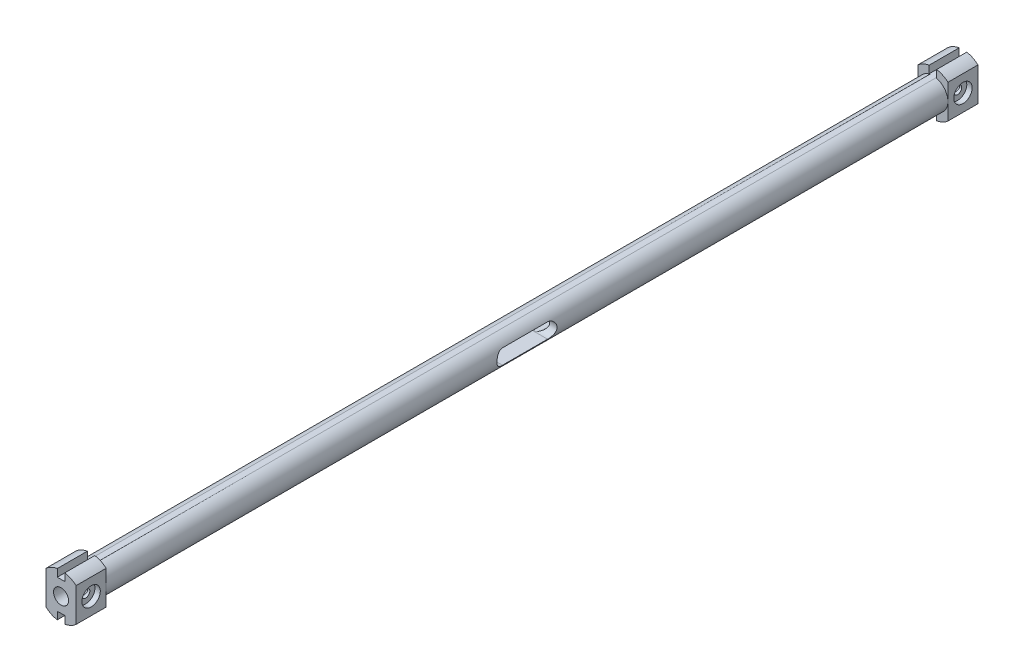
ISO-10303-21;
HEADER;
FILE_DESCRIPTION(('STEP AP214'),'2;1');
FILE_NAME('part.step','',(''),(''),'','','');
FILE_SCHEMA(('AUTOMOTIVE_DESIGN { 1 0 10303 214 1 1 1 1 }'));
ENDSEC;
DATA;
#1=APPLICATION_CONTEXT('core data for automotive mechanical design processes');
#2=APPLICATION_PROTOCOL_DEFINITION('international standard','automotive_design',2000,#1);
#3=PRODUCT_CONTEXT('',#1,'mechanical');
#4=PRODUCT('Part','Part','',(#3));
#5=PRODUCT_RELATED_PRODUCT_CATEGORY('part','',(#4));
#6=PRODUCT_DEFINITION_FORMATION('','',#4);
#7=PRODUCT_DEFINITION_CONTEXT('part definition',#1,'design');
#8=PRODUCT_DEFINITION('design','',#6,#7);
#9=PRODUCT_DEFINITION_SHAPE('','',#8);
#10=(LENGTH_UNIT() NAMED_UNIT(*) SI_UNIT(.MILLI.,.METRE.));
#11=(NAMED_UNIT(*) PLANE_ANGLE_UNIT() SI_UNIT($,.RADIAN.));
#12=(NAMED_UNIT(*) SI_UNIT($,.STERADIAN.) SOLID_ANGLE_UNIT());
#13=UNCERTAINTY_MEASURE_WITH_UNIT(LENGTH_MEASURE(1.E-05),#10,'distance_accuracy_value','');
#14=(GEOMETRIC_REPRESENTATION_CONTEXT(3) GLOBAL_UNCERTAINTY_ASSIGNED_CONTEXT((#13)) GLOBAL_UNIT_ASSIGNED_CONTEXT((#10,
#11,#12)) REPRESENTATION_CONTEXT('',''));
#15=CARTESIAN_POINT('',(0.,0.,0.));
#16=DIRECTION('',(0.,0.,1.));
#17=DIRECTION('',(1.,0.,0.));
#18=AXIS2_PLACEMENT_3D('',#15,#16,#17);
#19=CARTESIAN_POINT('',(0.,9.99999999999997,-280.));
#20=DIRECTION('',(0.,0.,1.));
#21=DIRECTION('',(-1.,0.,0.));
#22=AXIS2_PLACEMENT_3D('',#19,#20,#21);
#23=PLANE('',#22);
#24=DIRECTION('',(0.,-1.,0.));
#25=VECTOR('',#24,1.);
#26=CARTESIAN_POINT('',(-2.49999999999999,9.99999999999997,-280.));
#27=LINE('',#26,#25);
#28=CARTESIAN_POINT('',(-2.50000000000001,-9.79019945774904,-280.));
#29=VERTEX_POINT('',#28);
#30=CARTESIAN_POINT('',(-2.50000000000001,-14.790199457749,-280.));
#31=VERTEX_POINT('',#30);
#32=EDGE_CURVE('E331',#29,#31,#27,.T.);
#33=ORIENTED_EDGE('',*,*,#32,.F.);
#34=DIRECTION('',(-1.,0.,0.));
#35=VECTOR('',#34,1.);
#36=CARTESIAN_POINT('',(0.,-9.79019945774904,-280.));
#37=LINE('',#36,#35);
#38=CARTESIAN_POINT('',(-2.03764436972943,-9.79019945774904,-280.));
#39=VERTEX_POINT('',#38);
#40=EDGE_CURVE('E326',#39,#29,#37,.T.);
#41=ORIENTED_EDGE('',*,*,#40,.F.);
#42=CARTESIAN_POINT('',(0.,0.,-280.));
#43=DIRECTION('',(0.,0.,-1.));
#44=DIRECTION('',(-1.,0.,0.));
#45=AXIS2_PLACEMENT_3D('',#42,#43,#44);
#46=CIRCLE('',#45,9.99999999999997);
#47=CARTESIAN_POINT('',(-9.99999999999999,0.,-280.));
#48=VERTEX_POINT('',#47);
#49=EDGE_CURVE('E699',#39,#48,#46,.T.);
#50=ORIENTED_EDGE('',*,*,#49,.T.);
#51=DIRECTION('',(0.,-1.,0.));
#52=VECTOR('',#51,1.);
#53=CARTESIAN_POINT('',(-10.,9.99999999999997,-280.));
#54=LINE('',#53,#52);
#55=CARTESIAN_POINT('',(-10.,-11.1803398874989,-280.));
#56=VERTEX_POINT('',#55);
#57=EDGE_CURVE('E666',#48,#56,#54,.T.);
#58=ORIENTED_EDGE('',*,*,#57,.T.);
#59=CARTESIAN_POINT('',(0.,0.,-280.));
#60=DIRECTION('',(0.,0.,-1.));
#61=DIRECTION('',(-1.,0.,0.));
#62=AXIS2_PLACEMENT_3D('',#59,#60,#61);
#63=CIRCLE('',#62,15.);
#64=EDGE_CURVE('E693',#31,#56,#63,.T.);
#65=ORIENTED_EDGE('',*,*,#64,.F.);
#66=EDGE_LOOP('',(#33,#41,#50,#58,#65));
#67=FACE_BOUND('',#66,.T.);
#68=ADVANCED_FACE('F33',(#67),#23,.T.);
#69=CARTESIAN_POINT('',(0.,0.,0.));
#70=DIRECTION('',(0.,0.,1.));
#71=DIRECTION('',(-1.,0.,0.));
#72=AXIS2_PLACEMENT_3D('',#69,#70,#71);
#73=CYLINDRICAL_SURFACE('',#72,15.);
#74=DIRECTION('',(0.,0.,1.));
#75=VECTOR('',#74,1.);
#76=CARTESIAN_POINT('',(-2.50000000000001,-14.790199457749,-300.));
#77=LINE('',#76,#75);
#78=CARTESIAN_POINT('',(-2.50000000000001,-14.790199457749,-300.));
#79=VERTEX_POINT('',#78);
#80=EDGE_CURVE('E306',#79,#31,#77,.T.);
#81=ORIENTED_EDGE('',*,*,#80,.T.);
#82=ORIENTED_EDGE('',*,*,#64,.T.);
#83=DIRECTION('',(0.,0.,-1.));
#84=VECTOR('',#83,1.);
#85=CARTESIAN_POINT('',(-10.,-11.1803398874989,300.));
#86=LINE('',#85,#84);
#87=CARTESIAN_POINT('',(-10.,-11.1803398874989,-300.));
#88=VERTEX_POINT('',#87);
#89=EDGE_CURVE('E663',#56,#88,#86,.T.);
#90=ORIENTED_EDGE('',*,*,#89,.T.);
#91=CARTESIAN_POINT('',(0.,0.,-300.));
#92=DIRECTION('',(0.,0.,-1.));
#93=DIRECTION('',(-1.,0.,0.));
#94=AXIS2_PLACEMENT_3D('',#91,#92,#93);
#95=CIRCLE('',#94,15.);
#96=EDGE_CURVE('E687',#79,#88,#95,.T.);
#97=ORIENTED_EDGE('',*,*,#96,.F.);
#98=EDGE_LOOP('',(#81,#82,#90,#97));
#99=FACE_BOUND('',#98,.T.);
#100=ADVANCED_FACE('F490',(#99),#73,.T.);
#101=CARTESIAN_POINT('',(0.,0.,0.));
#102=DIRECTION('',(0.,0.,-1.));
#103=DIRECTION('',(-1.,0.,0.));
#104=AXIS2_PLACEMENT_3D('',#101,#102,#103);
#105=CYLINDRICAL_SURFACE('',#104,15.);
#106=CARTESIAN_POINT('',(-2.50000000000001,-14.790199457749,280.));
#107=VERTEX_POINT('',#106);
#108=CARTESIAN_POINT('',(-2.50000000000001,-14.790199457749,300.));
#109=VERTEX_POINT('',#108);
#110=EDGE_CURVE('E310',#107,#109,#77,.T.);
#111=ORIENTED_EDGE('',*,*,#110,.T.);
#112=CARTESIAN_POINT('',(0.,0.,300.));
#113=DIRECTION('',(0.,0.,-1.));
#114=DIRECTION('',(-1.,0.,0.));
#115=AXIS2_PLACEMENT_3D('',#112,#113,#114);
#116=CIRCLE('',#115,15.);
#117=CARTESIAN_POINT('',(-10.,-11.1803398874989,300.));
#118=VERTEX_POINT('',#117);
#119=EDGE_CURVE('E732',#109,#118,#116,.T.);
#120=ORIENTED_EDGE('',*,*,#119,.T.);
#121=DIRECTION('',(0.,0.,1.));
#122=VECTOR('',#121,1.);
#123=CARTESIAN_POINT('',(-10.,-11.1803398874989,0.));
#124=LINE('',#123,#122);
#125=CARTESIAN_POINT('',(-10.,-11.1803398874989,280.));
#126=VERTEX_POINT('',#125);
#127=EDGE_CURVE('E713',#126,#118,#124,.T.);
#128=ORIENTED_EDGE('',*,*,#127,.F.);
#129=CARTESIAN_POINT('',(0.,0.,280.));
#130=DIRECTION('',(0.,0.,-1.));
#131=DIRECTION('',(-1.,0.,0.));
#132=AXIS2_PLACEMENT_3D('',#129,#130,#131);
#133=CIRCLE('',#132,15.);
#134=EDGE_CURVE('E537',#107,#126,#133,.T.);
#135=ORIENTED_EDGE('',*,*,#134,.F.);
#136=EDGE_LOOP('',(#111,#120,#128,#135));
#137=FACE_BOUND('',#136,.T.);
#138=ADVANCED_FACE('F471',(#137),#105,.T.);
#139=CARTESIAN_POINT('',(0.,0.,0.));
#140=DIRECTION('',(0.,0.,-1.));
#141=DIRECTION('',(-1.,0.,0.));
#142=AXIS2_PLACEMENT_3D('',#139,#140,#141);
#143=CYLINDRICAL_SURFACE('',#142,9.99999999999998);
#144=DIRECTION('',(0.,0.,-1.));
#145=VECTOR('',#144,1.);
#146=CARTESIAN_POINT('',(2.03764436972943,-9.79019945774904,0.));
#147=LINE('',#146,#145);
#148=CARTESIAN_POINT('',(2.03764436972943,-9.79019945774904,-280.));
#149=VERTEX_POINT('',#148);
#150=CARTESIAN_POINT('',(2.03764436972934,-9.79019945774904,280.));
#151=VERTEX_POINT('',#150);
#152=EDGE_CURVE('E321',#149,#151,#147,.F.);
#153=ORIENTED_EDGE('',*,*,#152,.F.);
#154=CARTESIAN_POINT('',(10.,0.,-280.));
#155=VERTEX_POINT('',#154);
#156=EDGE_CURVE('E695',#155,#149,#46,.T.);
#157=ORIENTED_EDGE('',*,*,#156,.F.);
#158=CARTESIAN_POINT('',(2.03764436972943,9.79019945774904,-280.));
#159=VERTEX_POINT('',#158);
#160=EDGE_CURVE('E692',#159,#155,#46,.T.);
#161=ORIENTED_EDGE('',*,*,#160,.F.);
#162=DIRECTION('',(0.,0.,-1.));
#163=VECTOR('',#162,1.);
#164=CARTESIAN_POINT('',(2.03764436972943,9.79019945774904,0.));
#165=LINE('',#164,#163);
#166=CARTESIAN_POINT('',(2.03764436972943,9.79019945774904,280.));
#167=VERTEX_POINT('',#166);
#168=EDGE_CURVE('E367',#167,#159,#165,.T.);
#169=ORIENTED_EDGE('',*,*,#168,.F.);
#170=CARTESIAN_POINT('',(0.,0.,280.));
#171=DIRECTION('',(0.,0.,-1.));
#172=DIRECTION('',(-1.,0.,0.));
#173=AXIS2_PLACEMENT_3D('',#170,#171,#172);
#174=CIRCLE('',#173,9.99999999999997);
#175=CARTESIAN_POINT('',(10.,0.,280.));
#176=VERTEX_POINT('',#175);
#177=EDGE_CURVE('E545',#167,#176,#174,.T.);
#178=ORIENTED_EDGE('',*,*,#177,.T.);
#179=EDGE_CURVE('E555',#176,#151,#174,.T.);
#180=ORIENTED_EDGE('',*,*,#179,.T.);
#181=EDGE_LOOP('',(#153,#157,#161,#169,#178,#180));
#182=FACE_BOUND('',#181,.T.);
#183=CARTESIAN_POINT('',(8.66025403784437,5.,15.));
#184=CARTESIAN_POINT('',(8.66021552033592,5.00002361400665,15.1309448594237));
#185=CARTESIAN_POINT('',(8.66322292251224,4.9948568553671,15.2618683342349));
#186=CARTESIAN_POINT('',(8.67503956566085,4.97432835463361,15.522571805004));
#187=CARTESIAN_POINT('',(8.68384524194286,4.95897287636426,15.6523524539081));
#188=CARTESIAN_POINT('',(8.70690282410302,4.91836897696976,15.9090950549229));
#189=CARTESIAN_POINT('',(8.72112322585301,4.8931777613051,16.0360688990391));
#190=CARTESIAN_POINT('',(8.75448565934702,4.83323443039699,16.2870552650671));
#191=CARTESIAN_POINT('',(8.77362825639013,4.79848121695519,16.4110674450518));
#192=CARTESIAN_POINT('',(8.83742418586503,4.68059421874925,16.7769277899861));
#193=CARTESIAN_POINT('',(8.88852160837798,4.58370758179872,17.0133763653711));
#194=CARTESIAN_POINT('',(9.00204283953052,4.35652191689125,17.46683536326));
#195=CARTESIAN_POINT('',(9.06448415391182,4.22617111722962,17.6838149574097));
#196=CARTESIAN_POINT('',(9.19984832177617,3.92332753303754,18.1115361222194));
#197=CARTESIAN_POINT('',(9.27321075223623,3.74825998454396,18.3203160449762));
#198=CARTESIAN_POINT('',(9.41862456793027,3.36618253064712,18.7071093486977));
#199=CARTESIAN_POINT('',(9.49067559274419,3.15916398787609,18.8851143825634));
#200=CARTESIAN_POINT('',(9.59484425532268,2.8203326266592,19.1312260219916));
#201=CARTESIAN_POINT('',(9.62993521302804,2.69838307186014,19.2119123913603));
#202=CARTESIAN_POINT('',(9.69680101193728,2.44722349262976,19.3626274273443));
#203=CARTESIAN_POINT('',(9.72857716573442,2.31801637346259,19.432660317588));
#204=CARTESIAN_POINT('',(9.78789466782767,2.0531765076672,19.5613750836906));
#205=CARTESIAN_POINT('',(9.81543707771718,1.91754538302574,19.6200598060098));
#206=CARTESIAN_POINT('',(9.86547225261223,1.64079804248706,19.7254306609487));
#207=CARTESIAN_POINT('',(9.88796555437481,1.49968241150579,19.7721180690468));
#208=CARTESIAN_POINT('',(9.92580345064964,1.22330545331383,19.8500152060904));
#209=CARTESIAN_POINT('',(9.94154270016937,1.0883415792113,19.8820895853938));
#210=CARTESIAN_POINT('',(9.96761533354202,0.815713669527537,19.9349656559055));
#211=CARTESIAN_POINT('',(9.97794924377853,0.678049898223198,19.9557684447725));
#212=CARTESIAN_POINT('',(9.99290878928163,0.401222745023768,19.985819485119));
#213=CARTESIAN_POINT('',(9.99753708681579,0.2620600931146,19.9950731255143));
#214=CARTESIAN_POINT('',(10.0009568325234,-0.0166197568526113,20.0019143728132));
#215=CARTESIAN_POINT('',(9.99974863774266,-0.15613693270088,19.9995026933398));
#216=CARTESIAN_POINT('',(9.99189259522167,-0.422159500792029,19.9837693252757));
#217=CARTESIAN_POINT('',(9.98572860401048,-0.548737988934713,19.9714179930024));
#218=CARTESIAN_POINT('',(9.96872078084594,-0.800317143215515,19.9371666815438));
#219=CARTESIAN_POINT('',(9.95787547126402,-0.92531729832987,19.9152636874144));
#220=CARTESIAN_POINT('',(9.93176665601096,-1.17280949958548,19.8621523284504));
#221=CARTESIAN_POINT('',(9.91650471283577,-1.29530241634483,19.8309472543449));
#222=CARTESIAN_POINT('',(9.88192118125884,-1.53706975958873,19.7595515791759));
#223=CARTESIAN_POINT('',(9.86259803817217,-1.65634293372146,19.7193575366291));
#224=CARTESIAN_POINT('',(9.79859254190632,-2.01140164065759,19.5846261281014));
#225=CARTESIAN_POINT('',(9.74822697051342,-2.24122379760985,19.4766326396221));
#226=CARTESIAN_POINT('',(9.63687905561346,-2.6799208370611,19.2286723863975));
#227=CARTESIAN_POINT('',(9.5758927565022,-2.88878786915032,19.0886937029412));
#228=CARTESIAN_POINT('',(9.44222809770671,-3.30083676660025,18.7655474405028));
#229=CARTESIAN_POINT('',(9.36898946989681,-3.50161847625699,18.579549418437));
#230=CARTESIAN_POINT('',(9.22271533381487,-3.8705258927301,18.1770390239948));
#231=CARTESIAN_POINT('',(9.14968006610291,-4.03862220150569,17.9604994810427));
#232=CARTESIAN_POINT('',(9.0438835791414,-4.26800936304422,17.6087212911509));
#233=CARTESIAN_POINT('',(9.00825027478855,-4.3425045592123,17.4827733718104));
#234=CARTESIAN_POINT('',(8.94042357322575,-4.48048286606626,17.2241250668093));
#235=CARTESIAN_POINT('',(8.90822866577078,-4.54397081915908,17.0914276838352));
#236=CARTESIAN_POINT('',(8.84850577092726,-4.65920157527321,16.8203005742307));
#237=CARTESIAN_POINT('',(8.82096939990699,-4.7109655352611,16.6818817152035));
#238=CARTESIAN_POINT('',(8.7716116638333,-4.80224062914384,16.4001482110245));
#239=CARTESIAN_POINT('',(8.74978782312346,-4.84175707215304,16.2568357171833));
#240=CARTESIAN_POINT('',(8.70825525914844,-4.91615453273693,15.9305108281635));
#241=CARTESIAN_POINT('',(8.69039463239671,-4.94749058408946,15.7464219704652));
#242=CARTESIAN_POINT('',(8.67238767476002,-4.97893750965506,15.4679306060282));
#243=CARTESIAN_POINT('',(8.66784921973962,-4.98682704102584,15.3746091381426));
#244=CARTESIAN_POINT('',(8.66177877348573,-4.99736013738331,15.1875353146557));
#245=CARTESIAN_POINT('',(8.66024801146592,-5.00000155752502,15.0937827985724));
#246=CARTESIAN_POINT('',(8.66025403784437,-5.,15.));
#247=B_SPLINE_CURVE_WITH_KNOTS('',3,(#183,#184,#185,#186,#187,#188,#189,#190,#191,#192,#193,
#194,#195,#196,#197,#198,#199,#200,#201,#202,#203,#204,#205,#206,#207,#208,#209,#210,#211,#212,
#213,#214,#215,#216,#217,#218,#219,#220,#221,#222,#223,#224,#225,#226,#227,#228,#229,#230,#231,
#232,#233,#234,#235,#236,#237,#238,#239,#240,#241,#242,#243,#244,#245,#246),.UNSPECIFIED.,.F.,
.F.,(4,2,2,2,2,2,2,2,2,2,2,2,2,2,2,2,2,2,2,2,2,2,2,2,2,2,2,2,2,2,2,4),(0.,0.392663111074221,
0.785085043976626,1.17525782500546,1.56547543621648,2.3435695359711,3.12287474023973,
3.96591805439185,4.80918967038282,5.2598277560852,5.71028671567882,6.16063253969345,
6.6109304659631,7.02920191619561,7.4474326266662,7.86546811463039,8.28347802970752,
8.66501292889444,9.04666834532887,9.42818890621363,9.80985578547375,10.5829611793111,
11.3563551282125,12.2027949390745,13.0499925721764,13.5013153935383,13.9524391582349,
14.4027422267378,14.8528498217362,15.4139318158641,15.695056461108,15.9762959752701),.UNSPECIFIED.);
#248=CARTESIAN_POINT('',(8.66025403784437,5.,15.));
#249=VERTEX_POINT('',#248);
#250=CARTESIAN_POINT('',(8.66025403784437,-5.,15.));
#251=VERTEX_POINT('',#250);
#252=EDGE_CURVE('E611',#249,#251,#247,.T.);
#253=ORIENTED_EDGE('',*,*,#252,.F.);
#254=DIRECTION('',(0.,0.,-1.));
#255=VECTOR('',#254,1.);
#256=CARTESIAN_POINT('',(8.66025403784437,5.,0.));
#257=LINE('',#256,#255);
#258=CARTESIAN_POINT('',(8.66025403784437,5.,-15.));
#259=VERTEX_POINT('',#258);
#260=EDGE_CURVE('E569',#259,#249,#257,.F.);
#261=ORIENTED_EDGE('',*,*,#260,.F.);
#262=CARTESIAN_POINT('',(8.66025403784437,-5.,-15.));
#263=CARTESIAN_POINT('',(8.66021552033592,-5.00002361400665,-15.1309448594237));
#264=CARTESIAN_POINT('',(8.66322292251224,-4.9948568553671,-15.2618683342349));
#265=CARTESIAN_POINT('',(8.67503956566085,-4.97432835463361,-15.522571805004));
#266=CARTESIAN_POINT('',(8.68384524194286,-4.95897287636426,-15.6523524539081));
#267=CARTESIAN_POINT('',(8.70690282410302,-4.91836897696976,-15.9090950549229));
#268=CARTESIAN_POINT('',(8.72112322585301,-4.8931777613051,-16.0360688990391));
#269=CARTESIAN_POINT('',(8.75448565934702,-4.83323443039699,-16.2870552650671));
#270=CARTESIAN_POINT('',(8.77362825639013,-4.79848121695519,-16.4110674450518));
#271=CARTESIAN_POINT('',(8.83742418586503,-4.68059421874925,-16.7769277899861));
#272=CARTESIAN_POINT('',(8.88852160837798,-4.58370758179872,-17.0133763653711));
#273=CARTESIAN_POINT('',(9.00204283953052,-4.35652191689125,-17.46683536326));
#274=CARTESIAN_POINT('',(9.06448415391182,-4.22617111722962,-17.6838149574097));
#275=CARTESIAN_POINT('',(9.19984832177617,-3.92332753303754,-18.1115361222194));
#276=CARTESIAN_POINT('',(9.27321075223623,-3.74825998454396,-18.3203160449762));
#277=CARTESIAN_POINT('',(9.41862456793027,-3.36618253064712,-18.7071093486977));
#278=CARTESIAN_POINT('',(9.49067559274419,-3.15916398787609,-18.8851143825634));
#279=CARTESIAN_POINT('',(9.59484425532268,-2.8203326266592,-19.1312260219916));
#280=CARTESIAN_POINT('',(9.62993521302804,-2.69838307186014,-19.2119123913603));
#281=CARTESIAN_POINT('',(9.69680101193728,-2.44722349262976,-19.3626274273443));
#282=CARTESIAN_POINT('',(9.72857716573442,-2.31801637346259,-19.432660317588));
#283=CARTESIAN_POINT('',(9.78789466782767,-2.0531765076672,-19.5613750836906));
#284=CARTESIAN_POINT('',(9.81543707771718,-1.91754538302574,-19.6200598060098));
#285=CARTESIAN_POINT('',(9.86547225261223,-1.64079804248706,-19.7254306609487));
#286=CARTESIAN_POINT('',(9.88796555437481,-1.49968241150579,-19.7721180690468));
#287=CARTESIAN_POINT('',(9.92580345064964,-1.22330545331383,-19.8500152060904));
#288=CARTESIAN_POINT('',(9.94154270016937,-1.0883415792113,-19.8820895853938));
#289=CARTESIAN_POINT('',(9.96761533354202,-0.815713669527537,-19.9349656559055));
#290=CARTESIAN_POINT('',(9.97794924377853,-0.678049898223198,-19.9557684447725));
#291=CARTESIAN_POINT('',(9.99290878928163,-0.401222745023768,-19.985819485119));
#292=CARTESIAN_POINT('',(9.99753708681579,-0.2620600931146,-19.9950731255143));
#293=CARTESIAN_POINT('',(10.0009568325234,0.0166197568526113,-20.0019143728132));
#294=CARTESIAN_POINT('',(9.99974863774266,0.15613693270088,-19.9995026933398));
#295=CARTESIAN_POINT('',(9.99189259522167,0.422159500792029,-19.9837693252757));
#296=CARTESIAN_POINT('',(9.98572860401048,0.548737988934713,-19.9714179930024));
#297=CARTESIAN_POINT('',(9.96872078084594,0.800317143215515,-19.9371666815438));
#298=CARTESIAN_POINT('',(9.95787547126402,0.92531729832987,-19.9152636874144));
#299=CARTESIAN_POINT('',(9.93176665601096,1.17280949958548,-19.8621523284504));
#300=CARTESIAN_POINT('',(9.91650471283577,1.29530241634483,-19.8309472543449));
#301=CARTESIAN_POINT('',(9.88192118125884,1.53706975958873,-19.7595515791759));
#302=CARTESIAN_POINT('',(9.86259803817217,1.65634293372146,-19.7193575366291));
#303=CARTESIAN_POINT('',(9.79859254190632,2.01140164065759,-19.5846261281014));
#304=CARTESIAN_POINT('',(9.74822697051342,2.24122379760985,-19.4766326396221));
#305=CARTESIAN_POINT('',(9.63687905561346,2.6799208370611,-19.2286723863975));
#306=CARTESIAN_POINT('',(9.5758927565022,2.88878786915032,-19.0886937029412));
#307=CARTESIAN_POINT('',(9.44222809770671,3.30083676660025,-18.7655474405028));
#308=CARTESIAN_POINT('',(9.36898946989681,3.50161847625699,-18.579549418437));
#309=CARTESIAN_POINT('',(9.22271533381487,3.8705258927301,-18.1770390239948));
#310=CARTESIAN_POINT('',(9.14968006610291,4.03862220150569,-17.9604994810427));
#311=CARTESIAN_POINT('',(9.0438835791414,4.26800936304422,-17.6087212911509));
#312=CARTESIAN_POINT('',(9.00825027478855,4.3425045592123,-17.4827733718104));
#313=CARTESIAN_POINT('',(8.94042357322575,4.48048286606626,-17.2241250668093));
#314=CARTESIAN_POINT('',(8.90822866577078,4.54397081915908,-17.0914276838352));
#315=CARTESIAN_POINT('',(8.84850577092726,4.65920157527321,-16.8203005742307));
#316=CARTESIAN_POINT('',(8.82096939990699,4.7109655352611,-16.6818817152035));
#317=CARTESIAN_POINT('',(8.7716116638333,4.80224062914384,-16.4001482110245));
#318=CARTESIAN_POINT('',(8.74978782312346,4.84175707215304,-16.2568357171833));
#319=CARTESIAN_POINT('',(8.70825525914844,4.91615453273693,-15.9305108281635));
#320=CARTESIAN_POINT('',(8.69039463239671,4.94749058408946,-15.7464219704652));
#321=CARTESIAN_POINT('',(8.67238767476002,4.97893750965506,-15.4679306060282));
#322=CARTESIAN_POINT('',(8.66784921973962,4.98682704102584,-15.3746091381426));
#323=CARTESIAN_POINT('',(8.66177877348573,4.99736013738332,-15.1875353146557));
#324=CARTESIAN_POINT('',(8.66024801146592,5.00000155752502,-15.0937827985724));
#325=CARTESIAN_POINT('',(8.66025403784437,5.,-15.));
#326=B_SPLINE_CURVE_WITH_KNOTS('',3,(#262,#263,#264,#265,#266,#267,#268,#269,#270,#271,#272,
#273,#274,#275,#276,#277,#278,#279,#280,#281,#282,#283,#284,#285,#286,#287,#288,#289,#290,#291,
#292,#293,#294,#295,#296,#297,#298,#299,#300,#301,#302,#303,#304,#305,#306,#307,#308,#309,#310,
#311,#312,#313,#314,#315,#316,#317,#318,#319,#320,#321,#322,#323,#324,#325),.UNSPECIFIED.,.F.,
.F.,(4,2,2,2,2,2,2,2,2,2,2,2,2,2,2,2,2,2,2,2,2,2,2,2,2,2,2,2,2,2,2,4),(0.,0.392663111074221,
0.785085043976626,1.17525782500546,1.56547543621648,2.3435695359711,3.12287474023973,
3.96591805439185,4.80918967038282,5.2598277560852,5.71028671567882,6.16063253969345,
6.6109304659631,7.02920191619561,7.4474326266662,7.86546811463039,8.28347802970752,
8.66501292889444,9.04666834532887,9.42818890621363,9.80985578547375,10.5829611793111,
11.3563551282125,12.2027949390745,13.0499925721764,13.5013153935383,13.9524391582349,
14.4027422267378,14.8528498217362,15.4139318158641,15.695056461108,15.9762959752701),.UNSPECIFIED.);
#327=CARTESIAN_POINT('',(8.66025403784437,-5.,-15.));
#328=VERTEX_POINT('',#327);
#329=EDGE_CURVE('E563',#328,#259,#326,.T.);
#330=ORIENTED_EDGE('',*,*,#329,.F.);
#331=DIRECTION('',(0.,0.,-1.));
#332=VECTOR('',#331,1.);
#333=CARTESIAN_POINT('',(8.66025403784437,-5.,0.));
#334=LINE('',#333,#332);
#335=EDGE_CURVE('E559',#251,#328,#334,.T.);
#336=ORIENTED_EDGE('',*,*,#335,.F.);
#337=EDGE_LOOP('',(#253,#261,#330,#336));
#338=FACE_BOUND('',#337,.T.);
#339=ADVANCED_FACE('F481',(#182,#338),#143,.T.);
#340=CARTESIAN_POINT('',(0.,9.99999999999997,280.));
#341=DIRECTION('',(0.,0.,-1.));
#342=DIRECTION('',(-1.,0.,0.));
#343=AXIS2_PLACEMENT_3D('',#340,#341,#342);
#344=PLANE('',#343);
#345=DIRECTION('',(0.,1.,0.));
#346=VECTOR('',#345,1.);
#347=CARTESIAN_POINT('',(-2.49999999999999,9.99999999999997,280.));
#348=LINE('',#347,#346);
#349=CARTESIAN_POINT('',(-2.50000000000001,-9.79019945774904,280.));
#350=VERTEX_POINT('',#349);
#351=EDGE_CURVE('E329',#107,#350,#348,.T.);
#352=ORIENTED_EDGE('',*,*,#351,.F.);
#353=ORIENTED_EDGE('',*,*,#134,.T.);
#354=DIRECTION('',(0.,-1.,0.));
#355=VECTOR('',#354,1.);
#356=CARTESIAN_POINT('',(-10.,9.99999999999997,280.));
#357=LINE('',#356,#355);
#358=CARTESIAN_POINT('',(-10.,0.,280.));
#359=VERTEX_POINT('',#358);
#360=EDGE_CURVE('E716',#359,#126,#357,.T.);
#361=ORIENTED_EDGE('',*,*,#360,.F.);
#362=CARTESIAN_POINT('',(-2.03764436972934,-9.79019945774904,280.));
#363=VERTEX_POINT('',#362);
#364=EDGE_CURVE('E549',#363,#359,#174,.T.);
#365=ORIENTED_EDGE('',*,*,#364,.F.);
#366=DIRECTION('',(1.,0.,0.));
#367=VECTOR('',#366,1.);
#368=CARTESIAN_POINT('',(0.,-9.79019945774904,280.));
#369=LINE('',#368,#367);
#370=EDGE_CURVE('E322',#350,#363,#369,.T.);
#371=ORIENTED_EDGE('',*,*,#370,.F.);
#372=EDGE_LOOP('',(#352,#353,#361,#365,#371));
#373=FACE_BOUND('',#372,.T.);
#374=ADVANCED_FACE('F475',(#373),#344,.T.);
#375=DIRECTION('',(0.,1.,0.));
#376=VECTOR('',#375,1.);
#377=CARTESIAN_POINT('',(2.5,9.99999999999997,-280.));
#378=LINE('',#377,#376);
#379=CARTESIAN_POINT('',(2.5,9.79019945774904,-280.));
#380=VERTEX_POINT('',#379);
#381=CARTESIAN_POINT('',(2.5,14.790199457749,-280.));
#382=VERTEX_POINT('',#381);
#383=EDGE_CURVE('E379',#380,#382,#378,.T.);
#384=ORIENTED_EDGE('',*,*,#383,.F.);
#385=DIRECTION('',(1.,0.,0.));
#386=VECTOR('',#385,1.);
#387=CARTESIAN_POINT('',(0.,9.79019945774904,-280.));
#388=LINE('',#387,#386);
#389=EDGE_CURVE('E371',#159,#380,#388,.T.);
#390=ORIENTED_EDGE('',*,*,#389,.F.);
#391=ORIENTED_EDGE('',*,*,#160,.T.);
#392=DIRECTION('',(0.,1.,0.));
#393=VECTOR('',#392,1.);
#394=CARTESIAN_POINT('',(10.,9.99999999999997,-280.));
#395=LINE('',#394,#393);
#396=CARTESIAN_POINT('',(10.,11.1803398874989,-280.));
#397=VERTEX_POINT('',#396);
#398=EDGE_CURVE('E678',#155,#397,#395,.T.);
#399=ORIENTED_EDGE('',*,*,#398,.T.);
#400=EDGE_CURVE('E686',#382,#397,#63,.T.);
#401=ORIENTED_EDGE('',*,*,#400,.F.);
#402=EDGE_LOOP('',(#384,#390,#391,#399,#401));
#403=FACE_BOUND('',#402,.T.);
#404=ADVANCED_FACE('F483',(#403),#23,.T.);
#405=DIRECTION('',(0.,0.,1.));
#406=VECTOR('',#405,1.);
#407=CARTESIAN_POINT('',(2.5,14.790199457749,-300.));
#408=LINE('',#407,#406);
#409=CARTESIAN_POINT('',(2.5,14.790199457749,-300.));
#410=VERTEX_POINT('',#409);
#411=EDGE_CURVE('E349',#410,#382,#408,.T.);
#412=ORIENTED_EDGE('',*,*,#411,.T.);
#413=ORIENTED_EDGE('',*,*,#400,.T.);
#414=DIRECTION('',(0.,0.,-1.));
#415=VECTOR('',#414,1.);
#416=CARTESIAN_POINT('',(10.,11.1803398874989,300.));
#417=LINE('',#416,#415);
#418=CARTESIAN_POINT('',(10.,11.1803398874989,-300.));
#419=VERTEX_POINT('',#418);
#420=EDGE_CURVE('E675',#397,#419,#417,.T.);
#421=ORIENTED_EDGE('',*,*,#420,.T.);
#422=EDGE_CURVE('E816',#410,#419,#95,.T.);
#423=ORIENTED_EDGE('',*,*,#422,.F.);
#424=EDGE_LOOP('',(#412,#413,#421,#423));
#425=FACE_BOUND('',#424,.T.);
#426=ADVANCED_FACE('F496',(#425),#73,.T.);
#427=DIRECTION('',(0.,-1.,0.));
#428=VECTOR('',#427,1.);
#429=CARTESIAN_POINT('',(2.5,9.99999999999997,280.));
#430=LINE('',#429,#428);
#431=CARTESIAN_POINT('',(2.5,14.790199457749,280.));
#432=VERTEX_POINT('',#431);
#433=CARTESIAN_POINT('',(2.5,9.79019945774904,280.));
#434=VERTEX_POINT('',#433);
#435=EDGE_CURVE('E377',#432,#434,#430,.T.);
#436=ORIENTED_EDGE('',*,*,#435,.F.);
#437=CARTESIAN_POINT('',(10.,11.1803398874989,280.));
#438=VERTEX_POINT('',#437);
#439=EDGE_CURVE('E538',#432,#438,#133,.T.);
#440=ORIENTED_EDGE('',*,*,#439,.T.);
#441=DIRECTION('',(0.,1.,0.));
#442=VECTOR('',#441,1.);
#443=CARTESIAN_POINT('',(10.,9.99999999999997,280.));
#444=LINE('',#443,#442);
#445=EDGE_CURVE('E727',#176,#438,#444,.T.);
#446=ORIENTED_EDGE('',*,*,#445,.F.);
#447=ORIENTED_EDGE('',*,*,#177,.F.);
#448=DIRECTION('',(-1.,0.,0.));
#449=VECTOR('',#448,1.);
#450=CARTESIAN_POINT('',(0.,9.79019945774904,280.));
#451=LINE('',#450,#449);
#452=EDGE_CURVE('E369',#434,#167,#451,.T.);
#453=ORIENTED_EDGE('',*,*,#452,.F.);
#454=EDGE_LOOP('',(#436,#440,#446,#447,#453));
#455=FACE_BOUND('',#454,.T.);
#456=ADVANCED_FACE('F485',(#455),#344,.T.);
#457=CARTESIAN_POINT('',(2.5,14.790199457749,300.));
#458=VERTEX_POINT('',#457);
#459=EDGE_CURVE('E353',#432,#458,#408,.T.);
#460=ORIENTED_EDGE('',*,*,#459,.T.);
#461=CARTESIAN_POINT('',(10.,11.1803398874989,300.));
#462=VERTEX_POINT('',#461);
#463=EDGE_CURVE('E735',#458,#462,#116,.T.);
#464=ORIENTED_EDGE('',*,*,#463,.T.);
#465=DIRECTION('',(0.,0.,1.));
#466=VECTOR('',#465,1.);
#467=CARTESIAN_POINT('',(10.,11.1803398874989,0.));
#468=LINE('',#467,#466);
#469=EDGE_CURVE('E723',#438,#462,#468,.T.);
#470=ORIENTED_EDGE('',*,*,#469,.F.);
#471=ORIENTED_EDGE('',*,*,#439,.F.);
#472=EDGE_LOOP('',(#460,#464,#470,#471));
#473=FACE_BOUND('',#472,.T.);
#474=ADVANCED_FACE('F750',(#473),#105,.T.);
#475=CARTESIAN_POINT('',(10.,0.,290.));
#476=DIRECTION('',(1.,0.,0.));
#477=DIRECTION('',(0.,0.,-1.));
#478=AXIS2_PLACEMENT_3D('',#475,#476,#477);
#479=CYLINDRICAL_SURFACE('',#478,2.75);
#480=CARTESIAN_POINT('',(-5.,0.,287.25));
#481=CARTESIAN_POINT('',(-4.99999039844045,0.14277898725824,287.250010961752));
#482=CARTESIAN_POINT('',(-4.99382130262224,0.28568064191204,287.261184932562));
#483=CARTESIAN_POINT('',(-4.96974680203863,0.567144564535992,287.305336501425));
#484=CARTESIAN_POINT('',(-4.95182537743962,0.705700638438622,287.338343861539));
#485=CARTESIAN_POINT('',(-4.90609520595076,0.974002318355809,287.424424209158));
#486=CARTESIAN_POINT('',(-4.87832722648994,1.10378166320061,287.477414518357));
#487=CARTESIAN_POINT('',(-4.81535273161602,1.35234717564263,287.601464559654));
#488=CARTESIAN_POINT('',(-4.78014589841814,1.47113287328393,287.672525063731));
#489=CARTESIAN_POINT('',(-4.70255423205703,1.70352686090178,287.836191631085));
#490=CARTESIAN_POINT('',(-4.65984222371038,1.81621688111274,287.929943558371));
#491=CARTESIAN_POINT('',(-4.57292248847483,2.02514431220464,288.133821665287));
#492=CARTESIAN_POINT('',(-4.52871340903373,2.12136634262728,288.243962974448));
#493=CARTESIAN_POINT('',(-4.43869864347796,2.30419697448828,288.490367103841));
#494=CARTESIAN_POINT('',(-4.39316476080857,2.38892451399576,288.628134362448));
#495=CARTESIAN_POINT('',(-4.31130412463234,2.53369890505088,288.918749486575));
#496=CARTESIAN_POINT('',(-4.2749701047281,2.5937652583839,289.07158531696));
#497=CARTESIAN_POINT('',(-4.23281682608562,2.66155878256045,289.303866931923));
#498=CARTESIAN_POINT('',(-4.2210380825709,2.68014299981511,289.379199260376));
#499=CARTESIAN_POINT('',(-4.20133009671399,2.71093428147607,289.531633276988));
#500=CARTESIAN_POINT('',(-4.1933985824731,2.72314510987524,289.608733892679));
#501=CARTESIAN_POINT('',(-4.18177527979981,2.74096165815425,289.763940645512));
#502=CARTESIAN_POINT('',(-4.17807942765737,2.74657370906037,289.842045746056));
#503=CARTESIAN_POINT('',(-4.17508903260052,2.75111459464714,289.998507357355));
#504=CARTESIAN_POINT('',(-4.17579388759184,2.75004434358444,290.076863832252));
#505=CARTESIAN_POINT('',(-4.18361720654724,2.73815212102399,290.287283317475));
#506=CARTESIAN_POINT('',(-4.19484451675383,2.72108205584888,290.418906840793));
#507=CARTESIAN_POINT('',(-4.22838592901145,2.66864788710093,290.676908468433));
#508=CARTESIAN_POINT('',(-4.25070508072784,2.63327545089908,290.803284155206));
#509=CARTESIAN_POINT('',(-4.30427056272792,2.54479294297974,291.050796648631));
#510=CARTESIAN_POINT('',(-4.33569897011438,2.49131692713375,291.171761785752));
#511=CARTESIAN_POINT('',(-4.40401457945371,2.36845745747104,291.403620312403));
#512=CARTESIAN_POINT('',(-4.44090413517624,2.29906713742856,291.514509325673));
#513=CARTESIAN_POINT('',(-4.52298416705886,2.13363906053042,291.741490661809));
#514=CARTESIAN_POINT('',(-4.56856599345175,2.03512428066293,291.855643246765));
#515=CARTESIAN_POINT('',(-4.65828959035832,1.82040889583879,292.066711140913));
#516=CARTESIAN_POINT('',(-4.70243035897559,1.7041962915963,292.163614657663));
#517=CARTESIAN_POINT('',(-4.7878689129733,1.44767506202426,292.343691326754));
#518=CARTESIAN_POINT('',(-4.82877747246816,1.30627310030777,292.425507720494));
#519=CARTESIAN_POINT('',(-4.89952546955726,1.00892063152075,292.56346793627));
#520=CARTESIAN_POINT('',(-4.92937530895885,0.852983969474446,292.619635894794));
#521=CARTESIAN_POINT('',(-4.97222242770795,0.546511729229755,292.699353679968));
#522=CARTESIAN_POINT('',(-4.9865303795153,0.396825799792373,292.725454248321));
#523=CARTESIAN_POINT('',(-5.00138961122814,0.0945542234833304,292.752551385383));
#524=CARTESIAN_POINT('',(-5.00194968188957,-0.058029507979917,292.753563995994));
#525=CARTESIAN_POINT('',(-4.98990296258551,-0.345812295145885,292.73160913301));
#526=CARTESIAN_POINT('',(-4.97857765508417,-0.481252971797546,292.710975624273));
#527=CARTESIAN_POINT('',(-4.94577990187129,-0.746398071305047,292.65026237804));
#528=CARTESIAN_POINT('',(-4.92430642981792,-0.876101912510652,292.610180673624));
#529=CARTESIAN_POINT('',(-4.8724896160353,-1.12958905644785,292.511070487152));
#530=CARTESIAN_POINT('',(-4.84195785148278,-1.25317389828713,292.451636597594));
#531=CARTESIAN_POINT('',(-4.77473698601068,-1.48893850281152,292.316048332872));
#532=CARTESIAN_POINT('',(-4.73804563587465,-1.60111407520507,292.239887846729));
#533=CARTESIAN_POINT('',(-4.65700524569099,-1.82425828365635,292.063256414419));
#534=CARTESIAN_POINT('',(-4.61225876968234,-1.93368607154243,291.961018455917));
#535=CARTESIAN_POINT('',(-4.522758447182,-2.13466254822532,291.74013536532));
#536=CARTESIAN_POINT('',(-4.47800464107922,-2.2261925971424,291.621473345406));
#537=CARTESIAN_POINT('',(-4.38976013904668,-2.39579834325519,291.359688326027));
#538=CARTESIAN_POINT('',(-4.34663770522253,-2.47227629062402,291.215381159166));
#539=CARTESIAN_POINT('',(-4.2906676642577,-2.56739683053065,290.988788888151));
#540=CARTESIAN_POINT('',(-4.27346255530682,-2.59583862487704,290.911565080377));
#541=CARTESIAN_POINT('',(-4.2426921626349,-2.64583179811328,290.754235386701));
#542=CARTESIAN_POINT('',(-4.22912432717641,-2.66738800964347,290.674131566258));
#543=CARTESIAN_POINT('',(-4.20739315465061,-2.70152034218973,290.519554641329));
#544=CARTESIAN_POINT('',(-4.19883483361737,-2.71476195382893,290.445283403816));
#545=CARTESIAN_POINT('',(-4.1856093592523,-2.73510919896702,290.295597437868));
#546=CARTESIAN_POINT('',(-4.18093999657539,-2.74221831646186,290.220183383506));
#547=CARTESIAN_POINT('',(-4.17570870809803,-2.75017846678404,290.068914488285));
#548=CARTESIAN_POINT('',(-4.17514479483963,-2.75103252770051,289.993059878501));
#549=CARTESIAN_POINT('',(-4.17813734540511,-2.74648304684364,289.841644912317));
#550=CARTESIAN_POINT('',(-4.18169346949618,-2.74108002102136,289.76608453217));
#551=CARTESIAN_POINT('',(-4.19681461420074,-2.71792079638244,289.561396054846));
#552=CARTESIAN_POINT('',(-4.21231907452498,-2.69404506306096,289.43319061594));
#553=CARTESIAN_POINT('',(-4.25319792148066,-2.62902002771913,289.182982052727));
#554=CARTESIAN_POINT('',(-4.27857636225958,-2.58786362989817,289.060981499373));
#555=CARTESIAN_POINT('',(-4.3381638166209,-2.48675944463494,288.818108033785));
#556=CARTESIAN_POINT('',(-4.37281849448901,-2.42581508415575,288.697761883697));
#557=CARTESIAN_POINT('',(-4.44657746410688,-2.28780930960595,288.468204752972));
#558=CARTESIAN_POINT('',(-4.48568411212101,-2.21073934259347,288.358999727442));
#559=CARTESIAN_POINT('',(-4.57126757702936,-2.02858054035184,288.136917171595));
#560=CARTESIAN_POINT('',(-4.61793823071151,-1.92099295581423,288.026150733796));
#561=CARTESIAN_POINT('',(-4.70810944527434,-1.68800064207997,287.82352816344));
#562=CARTESIAN_POINT('',(-4.75160771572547,-1.56258322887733,287.731685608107));
#563=CARTESIAN_POINT('',(-4.83247282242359,-1.2914343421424,287.566760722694));
#564=CARTESIAN_POINT('',(-4.86957369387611,-1.14514793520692,287.494442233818));
#565=CARTESIAN_POINT('',(-4.91590777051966,-0.916482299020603,287.405918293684));
#566=CARTESIAN_POINT('',(-4.92979443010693,-0.838767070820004,287.379745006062));
#567=CARTESIAN_POINT('',(-4.95407426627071,-0.680818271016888,287.334343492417));
#568=CARTESIAN_POINT('',(-4.96446927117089,-0.600586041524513,287.315111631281));
#569=CARTESIAN_POINT('',(-4.98184694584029,-0.434213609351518,287.283110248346));
#570=CARTESIAN_POINT('',(-4.98863066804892,-0.347979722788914,287.270716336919));
#571=CARTESIAN_POINT('',(-4.99771009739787,-0.174512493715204,287.254157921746));
#572=CARTESIAN_POINT('',(-5.00000586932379,-0.0872791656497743,287.249993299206));
#573=CARTESIAN_POINT('',(-5.,0.,287.25));
#574=B_SPLINE_CURVE_WITH_KNOTS('',3,(#480,#481,#482,#483,#484,#485,#486,#487,#488,#489,#490,
#491,#492,#493,#494,#495,#496,#497,#498,#499,#500,#501,#502,#503,#504,#505,#506,#507,#508,#509,
#510,#511,#512,#513,#514,#515,#516,#517,#518,#519,#520,#521,#522,#523,#524,#525,#526,#527,#528,
#529,#530,#531,#532,#533,#534,#535,#536,#537,#538,#539,#540,#541,#542,#543,#544,#545,#546,#547,
#548,#549,#550,#551,#552,#553,#554,#555,#556,#557,#558,#559,#560,#561,#562,#563,#564,#565,#566,
#567,#568,#569,#570,#571,#572,#573),.UNSPECIFIED.,.T.,.F.,(4,2,2,2,2,2,2,2,2,2,2,2,2,2,2,2,2,2,
2,2,2,2,2,2,2,2,2,2,2,2,2,2,2,2,2,2,2,2,2,2,2,2,2,2,2,2,4),(0.,0.427998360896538,
0.856581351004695,1.28341021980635,1.71025732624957,2.166467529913,2.62310151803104,
3.12472304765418,3.62594713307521,3.86107858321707,4.09607101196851,4.33083779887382,
4.56557246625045,4.96309575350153,5.36080018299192,5.76707821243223,6.17353186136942,
6.6441183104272,7.11502525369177,7.61751511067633,8.119531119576,8.57479050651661,
9.02975878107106,9.44026180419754,9.85080635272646,10.2705736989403,10.6904946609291,
11.1574234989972,11.6248360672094,12.1285624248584,12.3804529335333,12.6321662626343,
12.8596075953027,13.0869196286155,13.3141216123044,13.5413048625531,13.9333695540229,
14.3255953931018,14.7418450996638,15.1583161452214,15.6401170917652,16.12226251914,
16.6211820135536,16.8703635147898,17.1194143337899,17.381048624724,17.6426791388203),.UNSPECIFIED.);
#575=CARTESIAN_POINT('',(-5.,0.,287.25));
#576=VERTEX_POINT('',#575);
#577=EDGE_CURVE('E434',#576,#576,#574,.T.);
#578=ORIENTED_EDGE('',*,*,#577,.T.);
#579=EDGE_LOOP('',(#578));
#580=FACE_BOUND('',#579,.T.);
#581=CARTESIAN_POINT('',(-10.,0.,290.));
#582=DIRECTION('',(1.,0.,0.));
#583=DIRECTION('',(0.,0.,-1.));
#584=AXIS2_PLACEMENT_3D('',#581,#582,#583);
#585=CIRCLE('',#584,2.75);
#586=CARTESIAN_POINT('',(-10.,0.,287.25));
#587=VERTEX_POINT('',#586);
#588=EDGE_CURVE('E698',#587,#587,#585,.T.);
#589=ORIENTED_EDGE('',*,*,#588,.F.);
#590=EDGE_LOOP('',(#589));
#591=FACE_BOUND('',#590,.T.);
#592=ADVANCED_FACE('F446',(#580,#591),#479,.F.);
#593=CARTESIAN_POINT('',(10.,0.,-290.));
#594=DIRECTION('',(1.,0.,0.));
#595=DIRECTION('',(0.,0.,-1.));
#596=AXIS2_PLACEMENT_3D('',#593,#594,#595);
#597=CYLINDRICAL_SURFACE('',#596,2.75);
#598=CARTESIAN_POINT('',(-5.,0.,-292.75));
#599=CARTESIAN_POINT('',(-4.99999039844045,0.14277898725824,-292.749989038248));
#600=CARTESIAN_POINT('',(-4.99382130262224,0.28568064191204,-292.738815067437));
#601=CARTESIAN_POINT('',(-4.96974680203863,0.567144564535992,-292.694663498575));
#602=CARTESIAN_POINT('',(-4.95182537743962,0.705700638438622,-292.661656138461));
#603=CARTESIAN_POINT('',(-4.90609520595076,0.974002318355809,-292.575575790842));
#604=CARTESIAN_POINT('',(-4.87832722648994,1.10378166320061,-292.522585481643));
#605=CARTESIAN_POINT('',(-4.81535273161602,1.35234717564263,-292.398535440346));
#606=CARTESIAN_POINT('',(-4.78014589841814,1.47113287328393,-292.327474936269));
#607=CARTESIAN_POINT('',(-4.70255423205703,1.70352686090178,-292.163808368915));
#608=CARTESIAN_POINT('',(-4.65984222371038,1.81621688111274,-292.070056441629));
#609=CARTESIAN_POINT('',(-4.57292248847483,2.02514431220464,-291.866178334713));
#610=CARTESIAN_POINT('',(-4.52871340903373,2.12136634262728,-291.756037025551));
#611=CARTESIAN_POINT('',(-4.43869864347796,2.30419697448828,-291.509632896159));
#612=CARTESIAN_POINT('',(-4.39316476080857,2.38892451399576,-291.371865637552));
#613=CARTESIAN_POINT('',(-4.31130412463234,2.53369890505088,-291.081250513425));
#614=CARTESIAN_POINT('',(-4.2749701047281,2.5937652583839,-290.92841468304));
#615=CARTESIAN_POINT('',(-4.23281682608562,2.66155878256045,-290.696133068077));
#616=CARTESIAN_POINT('',(-4.2210380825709,2.68014299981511,-290.620800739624));
#617=CARTESIAN_POINT('',(-4.20133009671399,2.71093428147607,-290.468366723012));
#618=CARTESIAN_POINT('',(-4.1933985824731,2.72314510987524,-290.391266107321));
#619=CARTESIAN_POINT('',(-4.18177527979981,2.74096165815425,-290.236059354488));
#620=CARTESIAN_POINT('',(-4.17807942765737,2.74657370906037,-290.157954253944));
#621=CARTESIAN_POINT('',(-4.17508903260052,2.75111459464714,-290.001492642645));
#622=CARTESIAN_POINT('',(-4.17579388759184,2.75004434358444,-289.923136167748));
#623=CARTESIAN_POINT('',(-4.18361720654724,2.73815212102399,-289.712716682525));
#624=CARTESIAN_POINT('',(-4.19484451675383,2.72108205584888,-289.581093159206));
#625=CARTESIAN_POINT('',(-4.22838592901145,2.66864788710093,-289.323091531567));
#626=CARTESIAN_POINT('',(-4.25070508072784,2.63327545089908,-289.196715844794));
#627=CARTESIAN_POINT('',(-4.30427056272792,2.54479294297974,-288.949203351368));
#628=CARTESIAN_POINT('',(-4.33569897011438,2.49131692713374,-288.828238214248));
#629=CARTESIAN_POINT('',(-4.40401457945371,2.36845745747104,-288.596379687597));
#630=CARTESIAN_POINT('',(-4.44090413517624,2.29906713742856,-288.485490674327));
#631=CARTESIAN_POINT('',(-4.52298416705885,2.13363906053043,-288.258509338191));
#632=CARTESIAN_POINT('',(-4.56856599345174,2.03512428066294,-288.144356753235));
#633=CARTESIAN_POINT('',(-4.65828959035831,1.82040889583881,-287.933288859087));
#634=CARTESIAN_POINT('',(-4.70243035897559,1.70419629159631,-287.836385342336));
#635=CARTESIAN_POINT('',(-4.7878689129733,1.44767506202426,-287.656308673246));
#636=CARTESIAN_POINT('',(-4.82877747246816,1.30627310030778,-287.574492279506));
#637=CARTESIAN_POINT('',(-4.89952546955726,1.00892063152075,-287.43653206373));
#638=CARTESIAN_POINT('',(-4.92937530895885,0.852983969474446,-287.380364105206));
#639=CARTESIAN_POINT('',(-4.97222242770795,0.546511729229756,-287.300646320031));
#640=CARTESIAN_POINT('',(-4.9865303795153,0.396825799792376,-287.274545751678));
#641=CARTESIAN_POINT('',(-5.00138961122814,0.0945542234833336,-287.247448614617));
#642=CARTESIAN_POINT('',(-5.00194968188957,-0.0580295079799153,-287.246436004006));
#643=CARTESIAN_POINT('',(-4.98990296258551,-0.345812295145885,-287.26839086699));
#644=CARTESIAN_POINT('',(-4.97857765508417,-0.481252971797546,-287.289024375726));
#645=CARTESIAN_POINT('',(-4.94577990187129,-0.746398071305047,-287.34973762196));
#646=CARTESIAN_POINT('',(-4.92430642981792,-0.876101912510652,-287.389819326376));
#647=CARTESIAN_POINT('',(-4.8724896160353,-1.12958905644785,-287.488929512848));
#648=CARTESIAN_POINT('',(-4.84195785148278,-1.25317389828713,-287.548363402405));
#649=CARTESIAN_POINT('',(-4.77473698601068,-1.48893850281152,-287.683951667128));
#650=CARTESIAN_POINT('',(-4.73804563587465,-1.60111407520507,-287.760112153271));
#651=CARTESIAN_POINT('',(-4.65700524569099,-1.82425828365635,-287.936743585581));
#652=CARTESIAN_POINT('',(-4.61225876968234,-1.93368607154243,-288.038981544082));
#653=CARTESIAN_POINT('',(-4.522758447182,-2.13466254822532,-288.25986463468));
#654=CARTESIAN_POINT('',(-4.47800464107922,-2.2261925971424,-288.378526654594));
#655=CARTESIAN_POINT('',(-4.38976013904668,-2.39579834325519,-288.640311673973));
#656=CARTESIAN_POINT('',(-4.34663770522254,-2.47227629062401,-288.784618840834));
#657=CARTESIAN_POINT('',(-4.29066766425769,-2.56739683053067,-289.011211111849));
#658=CARTESIAN_POINT('',(-4.2734625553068,-2.59583862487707,-289.088434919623));
#659=CARTESIAN_POINT('',(-4.24269216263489,-2.6458317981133,-289.245764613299));
#660=CARTESIAN_POINT('',(-4.2291243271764,-2.66738800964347,-289.325868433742));
#661=CARTESIAN_POINT('',(-4.20739315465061,-2.70152034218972,-289.480445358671));
#662=CARTESIAN_POINT('',(-4.19883483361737,-2.71476195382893,-289.554716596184));
#663=CARTESIAN_POINT('',(-4.1856093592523,-2.73510919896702,-289.704402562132));
#664=CARTESIAN_POINT('',(-4.18093999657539,-2.74221831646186,-289.779816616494));
#665=CARTESIAN_POINT('',(-4.17570870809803,-2.75017846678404,-289.931085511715));
#666=CARTESIAN_POINT('',(-4.17514479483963,-2.75103252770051,-290.006940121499));
#667=CARTESIAN_POINT('',(-4.17813734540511,-2.74648304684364,-290.158355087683));
#668=CARTESIAN_POINT('',(-4.18169346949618,-2.74108002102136,-290.23391546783));
#669=CARTESIAN_POINT('',(-4.19681461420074,-2.71792079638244,-290.438603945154));
#670=CARTESIAN_POINT('',(-4.21231907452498,-2.69404506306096,-290.56680938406));
#671=CARTESIAN_POINT('',(-4.25319792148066,-2.62902002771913,-290.817017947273));
#672=CARTESIAN_POINT('',(-4.27857636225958,-2.58786362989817,-290.939018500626));
#673=CARTESIAN_POINT('',(-4.33816381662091,-2.48675944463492,-291.181891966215));
#674=CARTESIAN_POINT('',(-4.37281849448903,-2.42581508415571,-291.302238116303));
#675=CARTESIAN_POINT('',(-4.44657746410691,-2.2878093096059,-291.531795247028));
#676=CARTESIAN_POINT('',(-4.48568411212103,-2.21073934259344,-291.641000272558));
#677=CARTESIAN_POINT('',(-4.57126757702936,-2.02858054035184,-291.863082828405));
#678=CARTESIAN_POINT('',(-4.61793823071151,-1.92099295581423,-291.973849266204));
#679=CARTESIAN_POINT('',(-4.70810944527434,-1.68800064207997,-292.17647183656));
#680=CARTESIAN_POINT('',(-4.75160771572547,-1.56258322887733,-292.268314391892));
#681=CARTESIAN_POINT('',(-4.83247282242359,-1.2914343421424,-292.433239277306));
#682=CARTESIAN_POINT('',(-4.86957369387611,-1.14514793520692,-292.505557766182));
#683=CARTESIAN_POINT('',(-4.91590777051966,-0.916482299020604,-292.594081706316));
#684=CARTESIAN_POINT('',(-4.92979443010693,-0.838767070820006,-292.620254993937));
#685=CARTESIAN_POINT('',(-4.9540742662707,-0.68081827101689,-292.665656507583));
#686=CARTESIAN_POINT('',(-4.96446927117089,-0.600586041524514,-292.684888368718));
#687=CARTESIAN_POINT('',(-4.98184694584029,-0.434213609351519,-292.716889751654));
#688=CARTESIAN_POINT('',(-4.98863066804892,-0.347979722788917,-292.729283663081));
#689=CARTESIAN_POINT('',(-4.99771009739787,-0.174512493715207,-292.745842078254));
#690=CARTESIAN_POINT('',(-5.00000586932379,-0.0872791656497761,-292.750006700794));
#691=CARTESIAN_POINT('',(-5.,0.,-292.75));
#692=B_SPLINE_CURVE_WITH_KNOTS('',3,(#598,#599,#600,#601,#602,#603,#604,#605,#606,#607,#608,
#609,#610,#611,#612,#613,#614,#615,#616,#617,#618,#619,#620,#621,#622,#623,#624,#625,#626,#627,
#628,#629,#630,#631,#632,#633,#634,#635,#636,#637,#638,#639,#640,#641,#642,#643,#644,#645,#646,
#647,#648,#649,#650,#651,#652,#653,#654,#655,#656,#657,#658,#659,#660,#661,#662,#663,#664,#665,
#666,#667,#668,#669,#670,#671,#672,#673,#674,#675,#676,#677,#678,#679,#680,#681,#682,#683,#684,
#685,#686,#687,#688,#689,#690,#691),.UNSPECIFIED.,.T.,.F.,(4,2,2,2,2,2,2,2,2,2,2,2,2,2,2,2,2,2,
2,2,2,2,2,2,2,2,2,2,2,2,2,2,2,2,2,2,2,2,2,2,2,2,2,2,2,2,4),(0.,0.427998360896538,
0.856581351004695,1.28341021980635,1.71025732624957,2.166467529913,2.62310151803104,
3.12472304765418,3.62594713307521,3.86107858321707,4.09607101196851,4.33083779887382,
4.56557246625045,4.96309575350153,5.36080018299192,5.76707821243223,6.17353186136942,
6.64411831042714,7.11502525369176,7.61751511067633,8.119531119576,8.5747905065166,
9.02975878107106,9.44026180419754,9.85080635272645,10.2705736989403,10.6904946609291,
11.1574234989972,11.6248360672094,12.1285624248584,12.3804529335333,12.6321662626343,
12.8596075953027,13.0869196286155,13.3141216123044,13.5413048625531,13.9333695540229,
14.3255953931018,14.7418450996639,15.1583161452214,15.6401170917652,16.12226251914,
16.6211820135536,16.8703635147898,17.1194143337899,17.3810486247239,17.6426791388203),.UNSPECIFIED.);
#693=CARTESIAN_POINT('',(-5.,0.,-292.75));
#694=VERTEX_POINT('',#693);
#695=EDGE_CURVE('E406',#694,#694,#692,.T.);
#696=ORIENTED_EDGE('',*,*,#695,.T.);
#697=EDGE_LOOP('',(#696));
#698=FACE_BOUND('',#697,.T.);
#699=CARTESIAN_POINT('',(-10.,0.,-290.));
#700=DIRECTION('',(1.,0.,0.));
#701=DIRECTION('',(0.,0.,-1.));
#702=AXIS2_PLACEMENT_3D('',#699,#700,#701);
#703=CIRCLE('',#702,2.75);
#704=CARTESIAN_POINT('',(-10.,0.,-292.75));
#705=VERTEX_POINT('',#704);
#706=EDGE_CURVE('E640',#705,#705,#703,.T.);
#707=ORIENTED_EDGE('',*,*,#706,.F.);
#708=EDGE_LOOP('',(#707));
#709=FACE_BOUND('',#708,.T.);
#710=ADVANCED_FACE('F631',(#698,#709),#597,.F.);
#711=CARTESIAN_POINT('',(-15.,0.,15.));
#712=DIRECTION('',(1.,0.,0.));
#713=DIRECTION('',(0.,0.,-1.));
#714=AXIS2_PLACEMENT_3D('',#711,#712,#713);
#715=CYLINDRICAL_SURFACE('',#714,5.);
#716=DIRECTION('',(1.,0.,0.));
#717=VECTOR('',#716,1.);
#718=CARTESIAN_POINT('',(-15.,5.,15.));
#719=LINE('',#718,#717);
#720=CARTESIAN_POINT('',(-8.66025403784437,5.,15.));
#721=VERTEX_POINT('',#720);
#722=CARTESIAN_POINT('',(0.,5.,15.));
#723=VERTEX_POINT('',#722);
#724=EDGE_CURVE('E599',#721,#723,#719,.T.);
#725=ORIENTED_EDGE('',*,*,#724,.T.);
#726=CARTESIAN_POINT('',(0.,0.,15.));
#727=DIRECTION('',(0.707106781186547,0.,0.707106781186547));
#728=DIRECTION('',(0.707106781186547,0.,-0.707106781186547));
#729=AXIS2_PLACEMENT_3D('',#726,#727,#728);
#730=ELLIPSE('',#729,7.07106781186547,5.);
#731=CARTESIAN_POINT('',(0.,-5.,15.));
#732=VERTEX_POINT('',#731);
#733=EDGE_CURVE('E396',#723,#732,#730,.T.);
#734=ORIENTED_EDGE('',*,*,#733,.T.);
#735=DIRECTION('',(1.,0.,0.));
#736=VECTOR('',#735,1.);
#737=CARTESIAN_POINT('',(-15.,-5.,15.));
#738=LINE('',#737,#736);
#739=CARTESIAN_POINT('',(-8.66025403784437,-5.,15.));
#740=VERTEX_POINT('',#739);
#741=EDGE_CURVE('E648',#740,#732,#738,.T.);
#742=ORIENTED_EDGE('',*,*,#741,.F.);
#743=CARTESIAN_POINT('',(-8.66025403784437,-5.,15.));
#744=CARTESIAN_POINT('',(-8.66021552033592,-5.00002361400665,15.1309448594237));
#745=CARTESIAN_POINT('',(-8.66322292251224,-4.9948568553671,15.2618683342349));
#746=CARTESIAN_POINT('',(-8.67503956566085,-4.97432835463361,15.522571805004));
#747=CARTESIAN_POINT('',(-8.68384524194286,-4.95897287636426,15.6523524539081));
#748=CARTESIAN_POINT('',(-8.70690282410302,-4.91836897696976,15.9090950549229));
#749=CARTESIAN_POINT('',(-8.72112322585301,-4.8931777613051,16.0360688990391));
#750=CARTESIAN_POINT('',(-8.75448565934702,-4.83323443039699,16.2870552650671));
#751=CARTESIAN_POINT('',(-8.77362825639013,-4.79848121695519,16.4110674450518));
#752=CARTESIAN_POINT('',(-8.83742418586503,-4.68059421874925,16.7769277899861));
#753=CARTESIAN_POINT('',(-8.88852160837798,-4.58370758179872,17.0133763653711));
#754=CARTESIAN_POINT('',(-9.00204283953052,-4.35652191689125,17.46683536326));
#755=CARTESIAN_POINT('',(-9.06448415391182,-4.22617111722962,17.6838149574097));
#756=CARTESIAN_POINT('',(-9.19984832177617,-3.92332753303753,18.1115361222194));
#757=CARTESIAN_POINT('',(-9.27321075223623,-3.74825998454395,18.3203160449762));
#758=CARTESIAN_POINT('',(-9.41862456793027,-3.36618253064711,18.7071093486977));
#759=CARTESIAN_POINT('',(-9.49067559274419,-3.15916398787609,18.8851143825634));
#760=CARTESIAN_POINT('',(-9.59484425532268,-2.82033262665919,19.1312260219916));
#761=CARTESIAN_POINT('',(-9.62993521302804,-2.69838307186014,19.2119123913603));
#762=CARTESIAN_POINT('',(-9.69680101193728,-2.44722349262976,19.3626274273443));
#763=CARTESIAN_POINT('',(-9.72857716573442,-2.31801637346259,19.432660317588));
#764=CARTESIAN_POINT('',(-9.78789466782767,-2.0531765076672,19.5613750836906));
#765=CARTESIAN_POINT('',(-9.81543707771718,-1.91754538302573,19.6200598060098));
#766=CARTESIAN_POINT('',(-9.86547225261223,-1.64079804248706,19.7254306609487));
#767=CARTESIAN_POINT('',(-9.88796555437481,-1.49968241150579,19.7721180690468));
#768=CARTESIAN_POINT('',(-9.92580345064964,-1.22330545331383,19.8500152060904));
#769=CARTESIAN_POINT('',(-9.94154270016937,-1.0883415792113,19.8820895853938));
#770=CARTESIAN_POINT('',(-9.96761533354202,-0.815713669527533,19.9349656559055));
#771=CARTESIAN_POINT('',(-9.97794924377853,-0.678049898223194,19.9557684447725));
#772=CARTESIAN_POINT('',(-9.99290878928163,-0.401222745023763,19.985819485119));
#773=CARTESIAN_POINT('',(-9.99753708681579,-0.262060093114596,19.9950731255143));
#774=CARTESIAN_POINT('',(-10.0009568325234,0.0166197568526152,20.0019143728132));
#775=CARTESIAN_POINT('',(-9.99974863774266,0.156136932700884,19.9995026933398));
#776=CARTESIAN_POINT('',(-9.99189259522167,0.422159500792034,19.9837693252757));
#777=CARTESIAN_POINT('',(-9.98572860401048,0.548737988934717,19.9714179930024));
#778=CARTESIAN_POINT('',(-9.96872078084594,0.800317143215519,19.9371666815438));
#779=CARTESIAN_POINT('',(-9.95787547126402,0.925317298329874,19.9152636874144));
#780=CARTESIAN_POINT('',(-9.93176665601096,1.17280949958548,19.8621523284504));
#781=CARTESIAN_POINT('',(-9.91650471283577,1.29530241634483,19.8309472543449));
#782=CARTESIAN_POINT('',(-9.88192118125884,1.53706975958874,19.7595515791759));
#783=CARTESIAN_POINT('',(-9.86259803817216,1.65634293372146,19.7193575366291));
#784=CARTESIAN_POINT('',(-9.79859254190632,2.0114016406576,19.5846261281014));
#785=CARTESIAN_POINT('',(-9.74822697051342,2.24122379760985,19.4766326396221));
#786=CARTESIAN_POINT('',(-9.63687905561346,2.6799208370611,19.2286723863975));
#787=CARTESIAN_POINT('',(-9.5758927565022,2.88878786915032,19.0886937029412));
#788=CARTESIAN_POINT('',(-9.44222809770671,3.30083676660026,18.7655474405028));
#789=CARTESIAN_POINT('',(-9.36898946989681,3.50161847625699,18.579549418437));
#790=CARTESIAN_POINT('',(-9.22271533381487,3.8705258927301,18.1770390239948));
#791=CARTESIAN_POINT('',(-9.14968006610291,4.03862220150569,17.9604994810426));
#792=CARTESIAN_POINT('',(-9.0438835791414,4.26800936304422,17.6087212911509));
#793=CARTESIAN_POINT('',(-9.00825027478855,4.34250455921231,17.4827733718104));
#794=CARTESIAN_POINT('',(-8.94042357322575,4.48048286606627,17.2241250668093));
#795=CARTESIAN_POINT('',(-8.90822866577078,4.54397081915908,17.0914276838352));
#796=CARTESIAN_POINT('',(-8.84850577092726,4.65920157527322,16.8203005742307));
#797=CARTESIAN_POINT('',(-8.82096939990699,4.71096553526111,16.6818817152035));
#798=CARTESIAN_POINT('',(-8.7716116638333,4.80224062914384,16.4001482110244));
#799=CARTESIAN_POINT('',(-8.74978782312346,4.84175707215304,16.2568357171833));
#800=CARTESIAN_POINT('',(-8.70825525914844,4.91615453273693,15.9305108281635));
#801=CARTESIAN_POINT('',(-8.69039463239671,4.94749058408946,15.7464219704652));
#802=CARTESIAN_POINT('',(-8.67238767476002,4.97893750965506,15.4679306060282));
#803=CARTESIAN_POINT('',(-8.66784921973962,4.98682704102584,15.3746091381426));
#804=CARTESIAN_POINT('',(-8.66177877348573,4.99736013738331,15.1875353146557));
#805=CARTESIAN_POINT('',(-8.66024801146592,5.00000155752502,15.0937827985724));
#806=CARTESIAN_POINT('',(-8.66025403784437,5.,15.));
#807=B_SPLINE_CURVE_WITH_KNOTS('',3,(#743,#744,#745,#746,#747,#748,#749,#750,#751,#752,#753,
#754,#755,#756,#757,#758,#759,#760,#761,#762,#763,#764,#765,#766,#767,#768,#769,#770,#771,#772,
#773,#774,#775,#776,#777,#778,#779,#780,#781,#782,#783,#784,#785,#786,#787,#788,#789,#790,#791,
#792,#793,#794,#795,#796,#797,#798,#799,#800,#801,#802,#803,#804,#805,#806),.UNSPECIFIED.,.F.,
.F.,(4,2,2,2,2,2,2,2,2,2,2,2,2,2,2,2,2,2,2,2,2,2,2,2,2,2,2,2,2,2,2,4),(0.,0.392663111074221,
0.785085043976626,1.17525782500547,1.56547543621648,2.34356953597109,3.12287474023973,
3.96591805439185,4.80918967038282,5.2598277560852,5.71028671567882,6.16063253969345,
6.6109304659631,7.02920191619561,7.4474326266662,7.86546811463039,8.28347802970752,
8.66501292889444,9.04666834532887,9.42818890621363,9.80985578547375,10.5829611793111,
11.3563551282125,12.2027949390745,13.0499925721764,13.5013153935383,13.9524391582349,
14.4027422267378,14.8528498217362,15.4139318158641,15.695056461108,15.9762959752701),.UNSPECIFIED.);
#808=EDGE_CURVE('E11',#740,#721,#807,.T.);
#809=ORIENTED_EDGE('',*,*,#808,.T.);
#810=EDGE_LOOP('',(#725,#734,#742,#809));
#811=FACE_BOUND('',#810,.T.);
#812=ADVANCED_FACE('F623',(#811),#715,.F.);
#813=CARTESIAN_POINT('',(-15.,0.,-15.));
#814=DIRECTION('',(1.,0.,0.));
#815=DIRECTION('',(0.,0.,-1.));
#816=AXIS2_PLACEMENT_3D('',#813,#814,#815);
#817=CYLINDRICAL_SURFACE('',#816,5.);
#818=DIRECTION('',(1.,0.,0.));
#819=VECTOR('',#818,1.);
#820=CARTESIAN_POINT('',(-15.,5.,-15.));
#821=LINE('',#820,#819);
#822=CARTESIAN_POINT('',(0.,5.,-15.));
#823=VERTEX_POINT('',#822);
#824=EDGE_CURVE('E607',#823,#259,#821,.T.);
#825=ORIENTED_EDGE('',*,*,#824,.F.);
#826=CARTESIAN_POINT('',(0.,0.,-15.));
#827=DIRECTION('',(0.707106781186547,0.,0.707106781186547));
#828=DIRECTION('',(0.707106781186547,0.,-0.707106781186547));
#829=AXIS2_PLACEMENT_3D('',#826,#827,#828);
#830=ELLIPSE('',#829,7.07106781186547,5.);
#831=CARTESIAN_POINT('',(0.,-5.,-15.));
#832=VERTEX_POINT('',#831);
#833=EDGE_CURVE('E390',#823,#832,#830,.F.);
#834=ORIENTED_EDGE('',*,*,#833,.T.);
#835=DIRECTION('',(1.,0.,0.));
#836=VECTOR('',#835,1.);
#837=CARTESIAN_POINT('',(-15.,-5.,-15.));
#838=LINE('',#837,#836);
#839=EDGE_CURVE('E647',#832,#328,#838,.T.);
#840=ORIENTED_EDGE('',*,*,#839,.T.);
#841=ORIENTED_EDGE('',*,*,#329,.T.);
#842=EDGE_LOOP('',(#825,#834,#840,#841));
#843=FACE_BOUND('',#842,.T.);
#844=ADVANCED_FACE('F510',(#843),#817,.F.);
#845=CARTESIAN_POINT('',(-10.,11.1803398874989,300.));
#846=DIRECTION('',(-1.,0.,0.));
#847=DIRECTION('',(0.,0.,1.));
#848=AXIS2_PLACEMENT_3D('',#845,#846,#847);
#849=PLANE('',#848);
#850=DIRECTION('',(0.,0.,-1.));
#851=VECTOR('',#850,1.);
#852=CARTESIAN_POINT('',(-10.,11.1803398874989,300.));
#853=LINE('',#852,#851);
#854=CARTESIAN_POINT('',(-10.,11.1803398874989,-280.));
#855=VERTEX_POINT('',#854);
#856=CARTESIAN_POINT('',(-10.,11.1803398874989,-300.));
#857=VERTEX_POINT('',#856);
#858=EDGE_CURVE('E662',#855,#857,#853,.T.);
#859=ORIENTED_EDGE('',*,*,#858,.T.);
#860=DIRECTION('',(0.,1.,0.));
#861=VECTOR('',#860,1.);
#862=CARTESIAN_POINT('',(-10.,11.1803398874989,-300.));
#863=LINE('',#862,#861);
#864=EDGE_CURVE('E659',#88,#857,#863,.T.);
#865=ORIENTED_EDGE('',*,*,#864,.F.);
#866=ORIENTED_EDGE('',*,*,#89,.F.);
#867=ORIENTED_EDGE('',*,*,#57,.F.);
#868=EDGE_CURVE('E670',#855,#48,#54,.T.);
#869=ORIENTED_EDGE('',*,*,#868,.F.);
#870=EDGE_LOOP('',(#859,#865,#866,#867,#869));
#871=FACE_BOUND('',#870,.T.);
#872=ORIENTED_EDGE('',*,*,#706,.T.);
#873=EDGE_LOOP('',(#872));
#874=FACE_BOUND('',#873,.T.);
#875=ADVANCED_FACE('F503',(#871,#874),#849,.T.);
#876=CARTESIAN_POINT('',(-2.5,9.79019945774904,-280.));
#877=VERTEX_POINT('',#876);
#878=CARTESIAN_POINT('',(-2.03764436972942,9.79019945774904,-280.));
#879=VERTEX_POINT('',#878);
#880=EDGE_CURVE('E375',#877,#879,#388,.T.);
#881=ORIENTED_EDGE('',*,*,#880,.F.);
#882=DIRECTION('',(0.,-1.,0.));
#883=VECTOR('',#882,1.);
#884=CARTESIAN_POINT('',(-2.5,9.99999999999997,-280.));
#885=LINE('',#884,#883);
#886=CARTESIAN_POINT('',(-2.5,14.790199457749,-280.));
#887=VERTEX_POINT('',#886);
#888=EDGE_CURVE('E365',#887,#877,#885,.T.);
#889=ORIENTED_EDGE('',*,*,#888,.F.);
#890=EDGE_CURVE('E694',#855,#887,#63,.T.);
#891=ORIENTED_EDGE('',*,*,#890,.F.);
#892=ORIENTED_EDGE('',*,*,#868,.T.);
#893=EDGE_CURVE('E520',#48,#879,#46,.T.);
#894=ORIENTED_EDGE('',*,*,#893,.T.);
#895=EDGE_LOOP('',(#881,#889,#891,#892,#894));
#896=FACE_BOUND('',#895,.T.);
#897=ADVANCED_FACE('F447',(#896),#23,.T.);
#898=CARTESIAN_POINT('',(2.49999999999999,-9.79019945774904,-280.));
#899=VERTEX_POINT('',#898);
#900=EDGE_CURVE('E324',#899,#149,#37,.T.);
#901=ORIENTED_EDGE('',*,*,#900,.F.);
#902=DIRECTION('',(0.,1.,0.));
#903=VECTOR('',#902,1.);
#904=CARTESIAN_POINT('',(2.50000000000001,9.99999999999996,-280.));
#905=LINE('',#904,#903);
#906=CARTESIAN_POINT('',(2.49999999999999,-14.790199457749,-280.));
#907=VERTEX_POINT('',#906);
#908=EDGE_CURVE('E318',#907,#899,#905,.T.);
#909=ORIENTED_EDGE('',*,*,#908,.F.);
#910=CARTESIAN_POINT('',(10.,-11.1803398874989,-280.));
#911=VERTEX_POINT('',#910);
#912=EDGE_CURVE('E689',#911,#907,#63,.T.);
#913=ORIENTED_EDGE('',*,*,#912,.F.);
#914=EDGE_CURVE('E682',#911,#155,#395,.T.);
#915=ORIENTED_EDGE('',*,*,#914,.T.);
#916=ORIENTED_EDGE('',*,*,#156,.T.);
#917=EDGE_LOOP('',(#901,#909,#913,#915,#916));
#918=FACE_BOUND('',#917,.T.);
#919=ADVANCED_FACE('F501',(#918),#23,.T.);
#920=DIRECTION('',(0.,0.,1.));
#921=VECTOR('',#920,1.);
#922=CARTESIAN_POINT('',(2.49999999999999,-14.790199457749,-300.));
#923=LINE('',#922,#921);
#924=CARTESIAN_POINT('',(2.49999999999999,-14.790199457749,-300.));
#925=VERTEX_POINT('',#924);
#926=EDGE_CURVE('E282',#925,#907,#923,.T.);
#927=ORIENTED_EDGE('',*,*,#926,.F.);
#928=CARTESIAN_POINT('',(10.,-11.1803398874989,-300.));
#929=VERTEX_POINT('',#928);
#930=EDGE_CURVE('E683',#929,#925,#95,.T.);
#931=ORIENTED_EDGE('',*,*,#930,.F.);
#932=DIRECTION('',(0.,0.,-1.));
#933=VECTOR('',#932,1.);
#934=CARTESIAN_POINT('',(10.,-11.1803398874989,300.));
#935=LINE('',#934,#933);
#936=EDGE_CURVE('E674',#911,#929,#935,.T.);
#937=ORIENTED_EDGE('',*,*,#936,.F.);
#938=ORIENTED_EDGE('',*,*,#912,.T.);
#939=EDGE_LOOP('',(#927,#931,#937,#938));
#940=FACE_BOUND('',#939,.T.);
#941=ADVANCED_FACE('F497',(#940),#73,.T.);
#942=DIRECTION('',(0.,0.,1.));
#943=VECTOR('',#942,1.);
#944=CARTESIAN_POINT('',(-2.5,14.790199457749,-300.));
#945=LINE('',#944,#943);
#946=CARTESIAN_POINT('',(-2.5,14.790199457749,-300.));
#947=VERTEX_POINT('',#946);
#948=EDGE_CURVE('E362',#947,#887,#945,.T.);
#949=ORIENTED_EDGE('',*,*,#948,.F.);
#950=EDGE_CURVE('E688',#857,#947,#95,.T.);
#951=ORIENTED_EDGE('',*,*,#950,.F.);
#952=ORIENTED_EDGE('',*,*,#858,.F.);
#953=ORIENTED_EDGE('',*,*,#890,.T.);
#954=EDGE_LOOP('',(#949,#951,#952,#953));
#955=FACE_BOUND('',#954,.T.);
#956=ADVANCED_FACE('F815',(#955),#73,.T.);
#957=CARTESIAN_POINT('',(0.,15.,-300.));
#958=DIRECTION('',(0.,0.,-1.));
#959=DIRECTION('',(1.,0.,0.));
#960=AXIS2_PLACEMENT_3D('',#957,#958,#959);
#961=PLANE('',#960);
#962=DIRECTION('',(0.,-1.,0.));
#963=VECTOR('',#962,1.);
#964=CARTESIAN_POINT('',(-2.50000000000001,-14.790199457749,-300.));
#965=LINE('',#964,#963);
#966=CARTESIAN_POINT('',(-2.50000000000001,-9.79019945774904,-300.));
#967=VERTEX_POINT('',#966);
#968=EDGE_CURVE('E303',#967,#79,#965,.T.);
#969=ORIENTED_EDGE('',*,*,#968,.T.);
#970=ORIENTED_EDGE('',*,*,#96,.T.);
#971=ORIENTED_EDGE('',*,*,#864,.T.);
#972=ORIENTED_EDGE('',*,*,#950,.T.);
#973=DIRECTION('',(0.,-1.,0.));
#974=VECTOR('',#973,1.);
#975=CARTESIAN_POINT('',(-2.5,14.790199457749,-300.));
#976=LINE('',#975,#974);
#977=CARTESIAN_POINT('',(-2.5,9.79019945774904,-300.));
#978=VERTEX_POINT('',#977);
#979=EDGE_CURVE('E340',#947,#978,#976,.T.);
#980=ORIENTED_EDGE('',*,*,#979,.T.);
#981=DIRECTION('',(1.,0.,0.));
#982=VECTOR('',#981,1.);
#983=CARTESIAN_POINT('',(2.5,9.79019945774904,-300.));
#984=LINE('',#983,#982);
#985=CARTESIAN_POINT('',(2.5,9.79019945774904,-300.));
#986=VERTEX_POINT('',#985);
#987=EDGE_CURVE('E343',#978,#986,#984,.T.);
#988=ORIENTED_EDGE('',*,*,#987,.T.);
#989=DIRECTION('',(0.,1.,0.));
#990=VECTOR('',#989,1.);
#991=CARTESIAN_POINT('',(2.5,14.790199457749,-300.));
#992=LINE('',#991,#990);
#993=EDGE_CURVE('E346',#986,#410,#992,.T.);
#994=ORIENTED_EDGE('',*,*,#993,.T.);
#995=ORIENTED_EDGE('',*,*,#422,.T.);
#996=DIRECTION('',(0.,-1.,0.));
#997=VECTOR('',#996,1.);
#998=CARTESIAN_POINT('',(10.,11.1803398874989,-300.));
#999=LINE('',#998,#997);
#1000=EDGE_CURVE('E671',#419,#929,#999,.T.);
#1001=ORIENTED_EDGE('',*,*,#1000,.T.);
#1002=ORIENTED_EDGE('',*,*,#930,.T.);
#1003=DIRECTION('',(0.,1.,0.));
#1004=VECTOR('',#1003,1.);
#1005=CARTESIAN_POINT('',(2.49999999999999,-14.790199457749,-300.));
#1006=LINE('',#1005,#1004);
#1007=CARTESIAN_POINT('',(2.49999999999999,-9.79019945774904,-300.));
#1008=VERTEX_POINT('',#1007);
#1009=EDGE_CURVE('E295',#925,#1008,#1006,.T.);
#1010=ORIENTED_EDGE('',*,*,#1009,.T.);
#1011=DIRECTION('',(-1.,0.,0.));
#1012=VECTOR('',#1011,1.);
#1013=CARTESIAN_POINT('',(2.49999999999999,-9.79019945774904,-300.));
#1014=LINE('',#1013,#1012);
#1015=EDGE_CURVE('E300',#1008,#967,#1014,.T.);
#1016=ORIENTED_EDGE('',*,*,#1015,.T.);
#1017=EDGE_LOOP('',(#969,#970,#971,#972,#980,#988,#994,#995,#1001,#1002,#1010,#1016));
#1018=FACE_BOUND('',#1017,.T.);
#1019=CARTESIAN_POINT('',(0.,0.,-300.));
#1020=DIRECTION('',(0.,0.,1.));
#1021=DIRECTION('',(1.,0.,0.));
#1022=AXIS2_PLACEMENT_3D('',#1019,#1020,#1021);
#1023=CIRCLE('',#1022,5.);
#1024=CARTESIAN_POINT('',(5.,0.,-300.));
#1025=VERTEX_POINT('',#1024);
#1026=EDGE_CURVE('E384',#1025,#1025,#1023,.T.);
#1027=ORIENTED_EDGE('',*,*,#1026,.T.);
#1028=EDGE_LOOP('',(#1027));
#1029=FACE_BOUND('',#1028,.T.);
#1030=ADVANCED_FACE('F487',(#1018,#1029),#961,.T.);
#1031=CARTESIAN_POINT('',(-2.03764436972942,9.79019945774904,280.));
#1032=VERTEX_POINT('',#1031);
#1033=CARTESIAN_POINT('',(-2.5,9.79019945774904,280.));
#1034=VERTEX_POINT('',#1033);
#1035=EDGE_CURVE('E372',#1032,#1034,#451,.T.);
#1036=ORIENTED_EDGE('',*,*,#1035,.F.);
#1037=EDGE_CURVE('E548',#359,#1032,#174,.T.);
#1038=ORIENTED_EDGE('',*,*,#1037,.F.);
#1039=CARTESIAN_POINT('',(-10.,11.1803398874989,280.));
#1040=VERTEX_POINT('',#1039);
#1041=EDGE_CURVE('E535',#1040,#359,#357,.T.);
#1042=ORIENTED_EDGE('',*,*,#1041,.F.);
#1043=CARTESIAN_POINT('',(-2.5,14.790199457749,280.));
#1044=VERTEX_POINT('',#1043);
#1045=EDGE_CURVE('E533',#1040,#1044,#133,.T.);
#1046=ORIENTED_EDGE('',*,*,#1045,.T.);
#1047=DIRECTION('',(0.,1.,0.));
#1048=VECTOR('',#1047,1.);
#1049=CARTESIAN_POINT('',(-2.5,9.99999999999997,280.));
#1050=LINE('',#1049,#1048);
#1051=EDGE_CURVE('E352',#1034,#1044,#1050,.T.);
#1052=ORIENTED_EDGE('',*,*,#1051,.F.);
#1053=EDGE_LOOP('',(#1036,#1038,#1042,#1046,#1052));
#1054=FACE_BOUND('',#1053,.T.);
#1055=ADVANCED_FACE('F476',(#1054),#344,.T.);
#1056=CARTESIAN_POINT('',(2.49999999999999,-14.790199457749,280.));
#1057=VERTEX_POINT('',#1056);
#1058=CARTESIAN_POINT('',(2.49999999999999,-14.790199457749,300.));
#1059=VERTEX_POINT('',#1058);
#1060=EDGE_CURVE('E53',#1057,#1059,#923,.T.);
#1061=ORIENTED_EDGE('',*,*,#1060,.F.);
#1062=CARTESIAN_POINT('',(10.,-11.1803398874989,280.));
#1063=VERTEX_POINT('',#1062);
#1064=EDGE_CURVE('E540',#1063,#1057,#133,.T.);
#1065=ORIENTED_EDGE('',*,*,#1064,.F.);
#1066=DIRECTION('',(0.,0.,1.));
#1067=VECTOR('',#1066,1.);
#1068=CARTESIAN_POINT('',(10.,-11.1803398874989,0.));
#1069=LINE('',#1068,#1067);
#1070=CARTESIAN_POINT('',(10.,-11.1803398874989,300.));
#1071=VERTEX_POINT('',#1070);
#1072=EDGE_CURVE('E724',#1063,#1071,#1069,.T.);
#1073=ORIENTED_EDGE('',*,*,#1072,.T.);
#1074=EDGE_CURVE('E541',#1071,#1059,#116,.T.);
#1075=ORIENTED_EDGE('',*,*,#1074,.T.);
#1076=EDGE_LOOP('',(#1061,#1065,#1073,#1075));
#1077=FACE_BOUND('',#1076,.T.);
#1078=ADVANCED_FACE('F472',(#1077),#105,.T.);
#1079=DIRECTION('',(0.,0.,-1.));
#1080=VECTOR('',#1079,1.);
#1081=CARTESIAN_POINT('',(-2.03764436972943,-9.79019945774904,0.));
#1082=LINE('',#1081,#1080);
#1083=EDGE_CURVE('E327',#363,#39,#1082,.T.);
#1084=ORIENTED_EDGE('',*,*,#1083,.F.);
#1085=ORIENTED_EDGE('',*,*,#364,.T.);
#1086=ORIENTED_EDGE('',*,*,#1037,.T.);
#1087=DIRECTION('',(0.,0.,-1.));
#1088=VECTOR('',#1087,1.);
#1089=CARTESIAN_POINT('',(-2.03764436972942,9.79019945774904,0.));
#1090=LINE('',#1089,#1088);
#1091=EDGE_CURVE('E374',#879,#1032,#1090,.F.);
#1092=ORIENTED_EDGE('',*,*,#1091,.F.);
#1093=ORIENTED_EDGE('',*,*,#893,.F.);
#1094=ORIENTED_EDGE('',*,*,#49,.F.);
#1095=EDGE_LOOP('',(#1084,#1085,#1086,#1092,#1093,#1094));
#1096=FACE_BOUND('',#1095,.T.);
#1097=ORIENTED_EDGE('',*,*,#808,.F.);
#1098=DIRECTION('',(0.,0.,-1.));
#1099=VECTOR('',#1098,1.);
#1100=CARTESIAN_POINT('',(-8.66025403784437,-5.,0.));
#1101=LINE('',#1100,#1099);
#1102=CARTESIAN_POINT('',(-8.66025403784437,-5.,-15.));
#1103=VERTEX_POINT('',#1102);
#1104=EDGE_CURVE('E590',#1103,#740,#1101,.F.);
#1105=ORIENTED_EDGE('',*,*,#1104,.F.);
#1106=CARTESIAN_POINT('',(-8.66025403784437,5.,-15.));
#1107=CARTESIAN_POINT('',(-8.66021552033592,5.00002361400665,-15.1309448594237));
#1108=CARTESIAN_POINT('',(-8.66322292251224,4.9948568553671,-15.2618683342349));
#1109=CARTESIAN_POINT('',(-8.67503956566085,4.97432835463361,-15.522571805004));
#1110=CARTESIAN_POINT('',(-8.68384524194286,4.95897287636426,-15.6523524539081));
#1111=CARTESIAN_POINT('',(-8.70690282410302,4.91836897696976,-15.9090950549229));
#1112=CARTESIAN_POINT('',(-8.72112322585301,4.8931777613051,-16.0360688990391));
#1113=CARTESIAN_POINT('',(-8.75448565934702,4.83323443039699,-16.2870552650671));
#1114=CARTESIAN_POINT('',(-8.77362825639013,4.79848121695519,-16.4110674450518));
#1115=CARTESIAN_POINT('',(-8.83742418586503,4.68059421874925,-16.7769277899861));
#1116=CARTESIAN_POINT('',(-8.88852160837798,4.58370758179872,-17.0133763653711));
#1117=CARTESIAN_POINT('',(-9.00204283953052,4.35652191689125,-17.46683536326));
#1118=CARTESIAN_POINT('',(-9.06448415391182,4.22617111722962,-17.6838149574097));
#1119=CARTESIAN_POINT('',(-9.19984832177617,3.92332753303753,-18.1115361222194));
#1120=CARTESIAN_POINT('',(-9.27321075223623,3.74825998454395,-18.3203160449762));
#1121=CARTESIAN_POINT('',(-9.41862456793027,3.36618253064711,-18.7071093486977));
#1122=CARTESIAN_POINT('',(-9.49067559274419,3.15916398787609,-18.8851143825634));
#1123=CARTESIAN_POINT('',(-9.59484425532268,2.82033262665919,-19.1312260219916));
#1124=CARTESIAN_POINT('',(-9.62993521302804,2.69838307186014,-19.2119123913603));
#1125=CARTESIAN_POINT('',(-9.69680101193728,2.44722349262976,-19.3626274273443));
#1126=CARTESIAN_POINT('',(-9.72857716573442,2.31801637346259,-19.432660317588));
#1127=CARTESIAN_POINT('',(-9.78789466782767,2.0531765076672,-19.5613750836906));
#1128=CARTESIAN_POINT('',(-9.81543707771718,1.91754538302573,-19.6200598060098));
#1129=CARTESIAN_POINT('',(-9.86547225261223,1.64079804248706,-19.7254306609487));
#1130=CARTESIAN_POINT('',(-9.88796555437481,1.49968241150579,-19.7721180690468));
#1131=CARTESIAN_POINT('',(-9.92580345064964,1.22330545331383,-19.8500152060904));
#1132=CARTESIAN_POINT('',(-9.94154270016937,1.0883415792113,-19.8820895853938));
#1133=CARTESIAN_POINT('',(-9.96761533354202,0.815713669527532,-19.9349656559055));
#1134=CARTESIAN_POINT('',(-9.97794924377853,0.678049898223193,-19.9557684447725));
#1135=CARTESIAN_POINT('',(-9.99290878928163,0.401222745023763,-19.985819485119));
#1136=CARTESIAN_POINT('',(-9.99753708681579,0.262060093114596,-19.9950731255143));
#1137=CARTESIAN_POINT('',(-10.0009568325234,-0.0166197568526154,-20.0019143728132));
#1138=CARTESIAN_POINT('',(-9.99974863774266,-0.156136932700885,-19.9995026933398));
#1139=CARTESIAN_POINT('',(-9.99189259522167,-0.422159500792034,-19.9837693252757));
#1140=CARTESIAN_POINT('',(-9.98572860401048,-0.548737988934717,-19.9714179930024));
#1141=CARTESIAN_POINT('',(-9.96872078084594,-0.800317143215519,-19.9371666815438));
#1142=CARTESIAN_POINT('',(-9.95787547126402,-0.925317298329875,-19.9152636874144));
#1143=CARTESIAN_POINT('',(-9.93176665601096,-1.17280949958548,-19.8621523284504));
#1144=CARTESIAN_POINT('',(-9.91650471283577,-1.29530241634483,-19.8309472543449));
#1145=CARTESIAN_POINT('',(-9.88192118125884,-1.53706975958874,-19.7595515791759));
#1146=CARTESIAN_POINT('',(-9.86259803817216,-1.65634293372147,-19.7193575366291));
#1147=CARTESIAN_POINT('',(-9.79859254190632,-2.0114016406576,-19.5846261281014));
#1148=CARTESIAN_POINT('',(-9.74822697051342,-2.24122379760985,-19.4766326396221));
#1149=CARTESIAN_POINT('',(-9.63687905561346,-2.6799208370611,-19.2286723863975));
#1150=CARTESIAN_POINT('',(-9.5758927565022,-2.88878786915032,-19.0886937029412));
#1151=CARTESIAN_POINT('',(-9.44222809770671,-3.30083676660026,-18.7655474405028));
#1152=CARTESIAN_POINT('',(-9.36898946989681,-3.50161847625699,-18.579549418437));
#1153=CARTESIAN_POINT('',(-9.22271533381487,-3.8705258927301,-18.1770390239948));
#1154=CARTESIAN_POINT('',(-9.14968006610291,-4.03862220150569,-17.9604994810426));
#1155=CARTESIAN_POINT('',(-9.0438835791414,-4.26800936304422,-17.6087212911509));
#1156=CARTESIAN_POINT('',(-9.00825027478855,-4.34250455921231,-17.4827733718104));
#1157=CARTESIAN_POINT('',(-8.94042357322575,-4.48048286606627,-17.2241250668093));
#1158=CARTESIAN_POINT('',(-8.90822866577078,-4.54397081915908,-17.0914276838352));
#1159=CARTESIAN_POINT('',(-8.84850577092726,-4.65920157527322,-16.8203005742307));
#1160=CARTESIAN_POINT('',(-8.82096939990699,-4.71096553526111,-16.6818817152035));
#1161=CARTESIAN_POINT('',(-8.7716116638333,-4.80224062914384,-16.4001482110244));
#1162=CARTESIAN_POINT('',(-8.74978782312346,-4.84175707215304,-16.2568357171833));
#1163=CARTESIAN_POINT('',(-8.70825525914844,-4.91615453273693,-15.9305108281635));
#1164=CARTESIAN_POINT('',(-8.69039463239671,-4.94749058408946,-15.7464219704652));
#1165=CARTESIAN_POINT('',(-8.67238767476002,-4.97893750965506,-15.4679306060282));
#1166=CARTESIAN_POINT('',(-8.66784921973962,-4.98682704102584,-15.3746091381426));
#1167=CARTESIAN_POINT('',(-8.66177877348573,-4.99736013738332,-15.1875353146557));
#1168=CARTESIAN_POINT('',(-8.66024801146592,-5.00000155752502,-15.0937827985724));
#1169=CARTESIAN_POINT('',(-8.66025403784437,-5.,-15.));
#1170=B_SPLINE_CURVE_WITH_KNOTS('',3,(#1106,#1107,#1108,#1109,#1110,#1111,#1112,#1113,#1114,
#1115,#1116,#1117,#1118,#1119,#1120,#1121,#1122,#1123,#1124,#1125,#1126,#1127,#1128,#1129,#1130,
#1131,#1132,#1133,#1134,#1135,#1136,#1137,#1138,#1139,#1140,#1141,#1142,#1143,#1144,#1145,#1146,
#1147,#1148,#1149,#1150,#1151,#1152,#1153,#1154,#1155,#1156,#1157,#1158,#1159,#1160,#1161,#1162,
#1163,#1164,#1165,#1166,#1167,#1168,#1169),.UNSPECIFIED.,.F.,.F.,(4,2,2,2,2,2,2,2,2,2,2,2,2,2,2,
2,2,2,2,2,2,2,2,2,2,2,2,2,2,2,2,4),(0.,0.392663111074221,0.785085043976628,1.17525782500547,
1.56547543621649,2.34356953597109,3.12287474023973,3.96591805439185,4.80918967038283,
5.2598277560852,5.71028671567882,6.16063253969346,6.6109304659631,7.02920191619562,
7.4474326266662,7.8654681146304,8.28347802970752,8.66501292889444,9.04666834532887,
9.42818890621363,9.80985578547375,10.5829611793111,11.3563551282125,12.2027949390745,
13.0499925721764,13.5013153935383,13.9524391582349,14.4027422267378,14.8528498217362,
15.4139318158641,15.695056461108,15.9762959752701),.UNSPECIFIED.);
#1171=CARTESIAN_POINT('',(-8.66025403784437,5.,-15.));
#1172=VERTEX_POINT('',#1171);
#1173=EDGE_CURVE('E584',#1172,#1103,#1170,.T.);
#1174=ORIENTED_EDGE('',*,*,#1173,.F.);
#1175=DIRECTION('',(0.,0.,-1.));
#1176=VECTOR('',#1175,1.);
#1177=CARTESIAN_POINT('',(-8.66025403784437,5.,0.));
#1178=LINE('',#1177,#1176);
#1179=EDGE_CURVE('E46',#721,#1172,#1178,.T.);
#1180=ORIENTED_EDGE('',*,*,#1179,.F.);
#1181=EDGE_LOOP('',(#1097,#1105,#1174,#1180));
#1182=FACE_BOUND('',#1181,.T.);
#1183=ADVANCED_FACE('F35',(#1096,#1182),#143,.T.);
#1184=CARTESIAN_POINT('',(2.49999999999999,-9.79019945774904,280.));
#1185=VERTEX_POINT('',#1184);
#1186=EDGE_CURVE('E279',#151,#1185,#369,.T.);
#1187=ORIENTED_EDGE('',*,*,#1186,.F.);
#1188=ORIENTED_EDGE('',*,*,#179,.F.);
#1189=EDGE_CURVE('E731',#1063,#176,#444,.T.);
#1190=ORIENTED_EDGE('',*,*,#1189,.F.);
#1191=ORIENTED_EDGE('',*,*,#1064,.T.);
#1192=DIRECTION('',(0.,-1.,0.));
#1193=VECTOR('',#1192,1.);
#1194=CARTESIAN_POINT('',(2.50000000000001,9.99999999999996,280.));
#1195=LINE('',#1194,#1193);
#1196=EDGE_CURVE('E309',#1185,#1057,#1195,.T.);
#1197=ORIENTED_EDGE('',*,*,#1196,.F.);
#1198=EDGE_LOOP('',(#1187,#1188,#1190,#1191,#1197));
#1199=FACE_BOUND('',#1198,.T.);
#1200=ADVANCED_FACE('F469',(#1199),#344,.T.);
#1201=CARTESIAN_POINT('',(-2.5,14.790199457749,300.));
#1202=VERTEX_POINT('',#1201);
#1203=EDGE_CURVE('E61',#1044,#1202,#945,.T.);
#1204=ORIENTED_EDGE('',*,*,#1203,.F.);
#1205=ORIENTED_EDGE('',*,*,#1045,.F.);
#1206=DIRECTION('',(0.,0.,1.));
#1207=VECTOR('',#1206,1.);
#1208=CARTESIAN_POINT('',(-10.,11.1803398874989,0.));
#1209=LINE('',#1208,#1207);
#1210=CARTESIAN_POINT('',(-10.,11.1803398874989,300.));
#1211=VERTEX_POINT('',#1210);
#1212=EDGE_CURVE('E714',#1040,#1211,#1209,.T.);
#1213=ORIENTED_EDGE('',*,*,#1212,.T.);
#1214=EDGE_CURVE('E733',#1211,#1202,#116,.T.);
#1215=ORIENTED_EDGE('',*,*,#1214,.T.);
#1216=EDGE_LOOP('',(#1204,#1205,#1213,#1215));
#1217=FACE_BOUND('',#1216,.T.);
#1218=ADVANCED_FACE('F467',(#1217),#105,.T.);
#1219=CARTESIAN_POINT('',(0.,15.,300.));
#1220=DIRECTION('',(0.,0.,1.));
#1221=DIRECTION('',(1.,0.,0.));
#1222=AXIS2_PLACEMENT_3D('',#1219,#1220,#1221);
#1223=PLANE('',#1222);
#1224=DIRECTION('',(0.,-1.,0.));
#1225=VECTOR('',#1224,1.);
#1226=CARTESIAN_POINT('',(-2.50000000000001,-14.790199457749,300.));
#1227=LINE('',#1226,#1225);
#1228=CARTESIAN_POINT('',(-2.50000000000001,-9.79019945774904,300.));
#1229=VERTEX_POINT('',#1228);
#1230=EDGE_CURVE('E293',#1229,#109,#1227,.T.);
#1231=ORIENTED_EDGE('',*,*,#1230,.F.);
#1232=DIRECTION('',(-1.,0.,0.));
#1233=VECTOR('',#1232,1.);
#1234=CARTESIAN_POINT('',(2.49999999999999,-9.79019945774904,300.));
#1235=LINE('',#1234,#1233);
#1236=CARTESIAN_POINT('',(2.49999999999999,-9.79019945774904,300.));
#1237=VERTEX_POINT('',#1236);
#1238=EDGE_CURVE('E276',#1237,#1229,#1235,.T.);
#1239=ORIENTED_EDGE('',*,*,#1238,.F.);
#1240=DIRECTION('',(0.,1.,0.));
#1241=VECTOR('',#1240,1.);
#1242=CARTESIAN_POINT('',(2.49999999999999,-14.790199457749,300.));
#1243=LINE('',#1242,#1241);
#1244=EDGE_CURVE('E284',#1059,#1237,#1243,.T.);
#1245=ORIENTED_EDGE('',*,*,#1244,.F.);
#1246=ORIENTED_EDGE('',*,*,#1074,.F.);
#1247=DIRECTION('',(0.,-1.,0.));
#1248=VECTOR('',#1247,1.);
#1249=CARTESIAN_POINT('',(10.,11.1803398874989,300.));
#1250=LINE('',#1249,#1248);
#1251=EDGE_CURVE('E721',#462,#1071,#1250,.T.);
#1252=ORIENTED_EDGE('',*,*,#1251,.F.);
#1253=ORIENTED_EDGE('',*,*,#463,.F.);
#1254=DIRECTION('',(0.,1.,0.));
#1255=VECTOR('',#1254,1.);
#1256=CARTESIAN_POINT('',(2.5,14.790199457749,300.));
#1257=LINE('',#1256,#1255);
#1258=CARTESIAN_POINT('',(2.5,9.79019945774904,300.));
#1259=VERTEX_POINT('',#1258);
#1260=EDGE_CURVE('E338',#1259,#458,#1257,.T.);
#1261=ORIENTED_EDGE('',*,*,#1260,.F.);
#1262=DIRECTION('',(1.,0.,0.));
#1263=VECTOR('',#1262,1.);
#1264=CARTESIAN_POINT('',(2.5,9.79019945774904,300.));
#1265=LINE('',#1264,#1263);
#1266=CARTESIAN_POINT('',(-2.5,9.79019945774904,300.));
#1267=VERTEX_POINT('',#1266);
#1268=EDGE_CURVE('E335',#1267,#1259,#1265,.T.);
#1269=ORIENTED_EDGE('',*,*,#1268,.F.);
#1270=DIRECTION('',(0.,-1.,0.));
#1271=VECTOR('',#1270,1.);
#1272=CARTESIAN_POINT('',(-2.5,14.790199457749,300.));
#1273=LINE('',#1272,#1271);
#1274=EDGE_CURVE('E333',#1202,#1267,#1273,.T.);
#1275=ORIENTED_EDGE('',*,*,#1274,.F.);
#1276=ORIENTED_EDGE('',*,*,#1214,.F.);
#1277=DIRECTION('',(0.,1.,0.));
#1278=VECTOR('',#1277,1.);
#1279=CARTESIAN_POINT('',(-10.,11.1803398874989,300.));
#1280=LINE('',#1279,#1278);
#1281=EDGE_CURVE('E711',#118,#1211,#1280,.T.);
#1282=ORIENTED_EDGE('',*,*,#1281,.F.);
#1283=ORIENTED_EDGE('',*,*,#119,.F.);
#1284=EDGE_LOOP('',(#1231,#1239,#1245,#1246,#1252,#1253,#1261,#1269,#1275,#1276,#1282,#1283));
#1285=FACE_BOUND('',#1284,.T.);
#1286=CARTESIAN_POINT('',(0.,0.,300.));
#1287=DIRECTION('',(0.,0.,1.));
#1288=DIRECTION('',(1.,0.,0.));
#1289=AXIS2_PLACEMENT_3D('',#1286,#1287,#1288);
#1290=CIRCLE('',#1289,5.);
#1291=CARTESIAN_POINT('',(5.,0.,300.));
#1292=VERTEX_POINT('',#1291);
#1293=EDGE_CURVE('E381',#1292,#1292,#1290,.T.);
#1294=ORIENTED_EDGE('',*,*,#1293,.F.);
#1295=EDGE_LOOP('',(#1294));
#1296=FACE_BOUND('',#1295,.T.);
#1297=ADVANCED_FACE('F290',(#1285,#1296),#1223,.T.);
#1298=CARTESIAN_POINT('',(10.,11.1803398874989,0.));
#1299=DIRECTION('',(-1.,0.,0.));
#1300=DIRECTION('',(0.,0.,1.));
#1301=AXIS2_PLACEMENT_3D('',#1298,#1299,#1300);
#1302=PLANE('',#1301);
#1303=CARTESIAN_POINT('',(10.,0.,290.));
#1304=DIRECTION('',(1.,0.,0.));
#1305=DIRECTION('',(0.,0.,-1.));
#1306=AXIS2_PLACEMENT_3D('',#1303,#1304,#1305);
#1307=CIRCLE('',#1306,6.12);
#1308=CARTESIAN_POINT('',(10.,0.,283.88));
#1309=VERTEX_POINT('',#1308);
#1310=EDGE_CURVE('E708',#1309,#1309,#1307,.T.);
#1311=ORIENTED_EDGE('',*,*,#1310,.F.);
#1312=EDGE_LOOP('',(#1311));
#1313=FACE_BOUND('',#1312,.T.);
#1314=ORIENTED_EDGE('',*,*,#1189,.T.);
#1315=ORIENTED_EDGE('',*,*,#445,.T.);
#1316=ORIENTED_EDGE('',*,*,#469,.T.);
#1317=ORIENTED_EDGE('',*,*,#1251,.T.);
#1318=ORIENTED_EDGE('',*,*,#1072,.F.);
#1319=EDGE_LOOP('',(#1314,#1315,#1316,#1317,#1318));
#1320=FACE_BOUND('',#1319,.T.);
#1321=ADVANCED_FACE('F460',(#1313,#1320),#1302,.F.);
#1322=CARTESIAN_POINT('',(-10.,11.1803398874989,0.));
#1323=DIRECTION('',(1.,0.,0.));
#1324=DIRECTION('',(0.,0.,-1.));
#1325=AXIS2_PLACEMENT_3D('',#1322,#1323,#1324);
#1326=PLANE('',#1325);
#1327=ORIENTED_EDGE('',*,*,#588,.T.);
#1328=EDGE_LOOP('',(#1327));
#1329=FACE_BOUND('',#1328,.T.);
#1330=ORIENTED_EDGE('',*,*,#1041,.T.);
#1331=ORIENTED_EDGE('',*,*,#360,.T.);
#1332=ORIENTED_EDGE('',*,*,#127,.T.);
#1333=ORIENTED_EDGE('',*,*,#1281,.T.);
#1334=ORIENTED_EDGE('',*,*,#1212,.F.);
#1335=EDGE_LOOP('',(#1330,#1331,#1332,#1333,#1334));
#1336=FACE_BOUND('',#1335,.T.);
#1337=ADVANCED_FACE('F456',(#1329,#1336),#1326,.F.);
#1338=CARTESIAN_POINT('',(10.,0.,290.));
#1339=DIRECTION('',(1.,0.,0.));
#1340=DIRECTION('',(0.,0.,-1.));
#1341=AXIS2_PLACEMENT_3D('',#1338,#1339,#1340);
#1342=CYLINDRICAL_SURFACE('',#1341,6.12);
#1343=CARTESIAN_POINT('',(6.42,0.,290.));
#1344=DIRECTION('',(1.,0.,0.));
#1345=DIRECTION('',(0.,0.,-1.));
#1346=AXIS2_PLACEMENT_3D('',#1343,#1344,#1345);
#1347=CIRCLE('',#1346,6.12);
#1348=CARTESIAN_POINT('',(6.42,0.,283.88));
#1349=VERTEX_POINT('',#1348);
#1350=EDGE_CURVE('E705',#1349,#1349,#1347,.T.);
#1351=ORIENTED_EDGE('',*,*,#1350,.F.);
#1352=EDGE_LOOP('',(#1351));
#1353=FACE_BOUND('',#1352,.T.);
#1354=ORIENTED_EDGE('',*,*,#1310,.T.);
#1355=EDGE_LOOP('',(#1354));
#1356=FACE_BOUND('',#1355,.T.);
#1357=ADVANCED_FACE('F452',(#1353,#1356),#1342,.F.);
#1358=CARTESIAN_POINT('',(6.42,2.75,290.));
#1359=DIRECTION('',(-1.,0.,0.));
#1360=DIRECTION('',(0.,0.,1.));
#1361=AXIS2_PLACEMENT_3D('',#1358,#1359,#1360);
#1362=PLANE('',#1361);
#1363=CARTESIAN_POINT('',(6.42,0.,290.));
#1364=DIRECTION('',(1.,0.,0.));
#1365=DIRECTION('',(0.,0.,-1.));
#1366=AXIS2_PLACEMENT_3D('',#1363,#1364,#1365);
#1367=CIRCLE('',#1366,2.75);
#1368=CARTESIAN_POINT('',(6.42,0.,287.25));
#1369=VERTEX_POINT('',#1368);
#1370=EDGE_CURVE('E702',#1369,#1369,#1367,.T.);
#1371=ORIENTED_EDGE('',*,*,#1370,.F.);
#1372=EDGE_LOOP('',(#1371));
#1373=FACE_BOUND('',#1372,.T.);
#1374=ORIENTED_EDGE('',*,*,#1350,.T.);
#1375=EDGE_LOOP('',(#1374));
#1376=FACE_BOUND('',#1375,.T.);
#1377=ADVANCED_FACE('F444',(#1373,#1376),#1362,.F.);
#1378=CARTESIAN_POINT('',(5.,0.,287.25));
#1379=CARTESIAN_POINT('',(4.99999039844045,-0.142778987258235,287.250010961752));
#1380=CARTESIAN_POINT('',(4.99382130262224,-0.285680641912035,287.261184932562));
#1381=CARTESIAN_POINT('',(4.96974680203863,-0.567144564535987,287.305336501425));
#1382=CARTESIAN_POINT('',(4.95182537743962,-0.705700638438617,287.338343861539));
#1383=CARTESIAN_POINT('',(4.90609520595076,-0.974002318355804,287.424424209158));
#1384=CARTESIAN_POINT('',(4.87832722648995,-1.1037816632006,287.477414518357));
#1385=CARTESIAN_POINT('',(4.81535273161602,-1.35234717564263,287.601464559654));
#1386=CARTESIAN_POINT('',(4.78014589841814,-1.47113287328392,287.672525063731));
#1387=CARTESIAN_POINT('',(4.70255423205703,-1.70352686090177,287.836191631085));
#1388=CARTESIAN_POINT('',(4.65984222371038,-1.81621688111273,287.929943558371));
#1389=CARTESIAN_POINT('',(4.57292248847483,-2.02514431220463,288.133821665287));
#1390=CARTESIAN_POINT('',(4.52871340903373,-2.12136634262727,288.243962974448));
#1391=CARTESIAN_POINT('',(4.43869864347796,-2.30419697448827,288.490367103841));
#1392=CARTESIAN_POINT('',(4.39316476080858,-2.38892451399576,288.628134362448));
#1393=CARTESIAN_POINT('',(4.31130412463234,-2.53369890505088,288.918749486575));
#1394=CARTESIAN_POINT('',(4.2749701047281,-2.5937652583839,289.07158531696));
#1395=CARTESIAN_POINT('',(4.23281682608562,-2.66155878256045,289.303866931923));
#1396=CARTESIAN_POINT('',(4.2210380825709,-2.6801429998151,289.379199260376));
#1397=CARTESIAN_POINT('',(4.20133009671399,-2.71093428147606,289.531633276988));
#1398=CARTESIAN_POINT('',(4.19339858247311,-2.72314510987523,289.608733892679));
#1399=CARTESIAN_POINT('',(4.18177527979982,-2.74096165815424,289.763940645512));
#1400=CARTESIAN_POINT('',(4.17807942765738,-2.74657370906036,289.842045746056));
#1401=CARTESIAN_POINT('',(4.17508903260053,-2.75111459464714,289.998507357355));
#1402=CARTESIAN_POINT('',(4.17579388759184,-2.75004434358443,290.076863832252));
#1403=CARTESIAN_POINT('',(4.18361720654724,-2.73815212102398,290.287283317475));
#1404=CARTESIAN_POINT('',(4.19484451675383,-2.72108205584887,290.418906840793));
#1405=CARTESIAN_POINT('',(4.22838592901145,-2.66864788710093,290.676908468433));
#1406=CARTESIAN_POINT('',(4.25070508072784,-2.63327545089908,290.803284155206));
#1407=CARTESIAN_POINT('',(4.30427056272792,-2.54479294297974,291.050796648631));
#1408=CARTESIAN_POINT('',(4.33569897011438,-2.49131692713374,291.171761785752));
#1409=CARTESIAN_POINT('',(4.40401457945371,-2.36845745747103,291.403620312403));
#1410=CARTESIAN_POINT('',(4.44090413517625,-2.29906713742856,291.514509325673));
#1411=CARTESIAN_POINT('',(4.52298416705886,-2.13363906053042,291.741490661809));
#1412=CARTESIAN_POINT('',(4.56856599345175,-2.03512428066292,291.855643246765));
#1413=CARTESIAN_POINT('',(4.65828959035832,-1.82040889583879,292.066711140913));
#1414=CARTESIAN_POINT('',(4.70243035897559,-1.70419629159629,292.163614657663));
#1415=CARTESIAN_POINT('',(4.7878689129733,-1.44767506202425,292.343691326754));
#1416=CARTESIAN_POINT('',(4.82877747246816,-1.30627310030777,292.425507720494));
#1417=CARTESIAN_POINT('',(4.89952546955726,-1.00892063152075,292.56346793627));
#1418=CARTESIAN_POINT('',(4.92937530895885,-0.852983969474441,292.619635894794));
#1419=CARTESIAN_POINT('',(4.97222242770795,-0.546511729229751,292.699353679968));
#1420=CARTESIAN_POINT('',(4.9865303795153,-0.396825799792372,292.725454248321));
#1421=CARTESIAN_POINT('',(5.00138961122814,-0.0945542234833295,292.752551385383));
#1422=CARTESIAN_POINT('',(5.00194968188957,0.0580295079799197,292.753563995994));
#1423=CARTESIAN_POINT('',(4.98990296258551,0.345812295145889,292.73160913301));
#1424=CARTESIAN_POINT('',(4.97857765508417,0.481252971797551,292.710975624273));
#1425=CARTESIAN_POINT('',(4.94577990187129,0.746398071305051,292.65026237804));
#1426=CARTESIAN_POINT('',(4.92430642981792,0.876101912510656,292.610180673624));
#1427=CARTESIAN_POINT('',(4.8724896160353,1.12958905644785,292.511070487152));
#1428=CARTESIAN_POINT('',(4.84195785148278,1.25317389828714,292.451636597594));
#1429=CARTESIAN_POINT('',(4.77473698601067,1.48893850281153,292.316048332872));
#1430=CARTESIAN_POINT('',(4.73804563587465,1.60111407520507,292.239887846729));
#1431=CARTESIAN_POINT('',(4.65700524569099,1.82425828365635,292.063256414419));
#1432=CARTESIAN_POINT('',(4.61225876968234,1.93368607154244,291.961018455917));
#1433=CARTESIAN_POINT('',(4.522758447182,2.13466254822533,291.74013536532));
#1434=CARTESIAN_POINT('',(4.47800464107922,2.2261925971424,291.621473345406));
#1435=CARTESIAN_POINT('',(4.38976013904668,2.3957983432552,291.359688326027));
#1436=CARTESIAN_POINT('',(4.34663770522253,2.47227629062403,291.215381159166));
#1437=CARTESIAN_POINT('',(4.29066766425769,2.56739683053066,290.988788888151));
#1438=CARTESIAN_POINT('',(4.27346255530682,2.59583862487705,290.911565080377));
#1439=CARTESIAN_POINT('',(4.2426921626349,2.64583179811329,290.754235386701));
#1440=CARTESIAN_POINT('',(4.2291243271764,2.66738800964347,290.674131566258));
#1441=CARTESIAN_POINT('',(4.20739315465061,2.70152034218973,290.519554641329));
#1442=CARTESIAN_POINT('',(4.19883483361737,2.71476195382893,290.445283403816));
#1443=CARTESIAN_POINT('',(4.1856093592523,2.73510919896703,290.295597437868));
#1444=CARTESIAN_POINT('',(4.18093999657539,2.74221831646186,290.220183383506));
#1445=CARTESIAN_POINT('',(4.17570870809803,2.75017846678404,290.068914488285));
#1446=CARTESIAN_POINT('',(4.17514479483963,2.75103252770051,289.993059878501));
#1447=CARTESIAN_POINT('',(4.1781373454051,2.74648304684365,289.841644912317));
#1448=CARTESIAN_POINT('',(4.18169346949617,2.74108002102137,289.76608453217));
#1449=CARTESIAN_POINT('',(4.19681461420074,2.71792079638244,289.561396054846));
#1450=CARTESIAN_POINT('',(4.21231907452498,2.69404506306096,289.43319061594));
#1451=CARTESIAN_POINT('',(4.25319792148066,2.62902002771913,289.182982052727));
#1452=CARTESIAN_POINT('',(4.27857636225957,2.58786362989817,289.060981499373));
#1453=CARTESIAN_POINT('',(4.33816381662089,2.48675944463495,288.818108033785));
#1454=CARTESIAN_POINT('',(4.372818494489,2.42581508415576,288.697761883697));
#1455=CARTESIAN_POINT('',(4.44657746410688,2.28780930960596,288.468204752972));
#1456=CARTESIAN_POINT('',(4.48568411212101,2.21073934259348,288.358999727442));
#1457=CARTESIAN_POINT('',(4.57126757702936,2.02858054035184,288.136917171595));
#1458=CARTESIAN_POINT('',(4.6179382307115,1.92099295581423,288.026150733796));
#1459=CARTESIAN_POINT('',(4.70810944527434,1.68800064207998,287.82352816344));
#1460=CARTESIAN_POINT('',(4.75160771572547,1.56258322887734,287.731685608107));
#1461=CARTESIAN_POINT('',(4.83247282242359,1.29143434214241,287.566760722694));
#1462=CARTESIAN_POINT('',(4.86957369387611,1.14514793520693,287.494442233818));
#1463=CARTESIAN_POINT('',(4.91590777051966,0.916482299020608,287.405918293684));
#1464=CARTESIAN_POINT('',(4.92979443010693,0.83876707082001,287.379745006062));
#1465=CARTESIAN_POINT('',(4.9540742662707,0.680818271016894,287.334343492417));
#1466=CARTESIAN_POINT('',(4.96446927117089,0.600586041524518,287.315111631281));
#1467=CARTESIAN_POINT('',(4.98184694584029,0.434213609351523,287.283110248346));
#1468=CARTESIAN_POINT('',(4.98863066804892,0.347979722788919,287.270716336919));
#1469=CARTESIAN_POINT('',(4.99771009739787,0.174512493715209,287.254157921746));
#1470=CARTESIAN_POINT('',(5.00000586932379,0.0872791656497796,287.249993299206));
#1471=CARTESIAN_POINT('',(5.,0.,287.25));
#1472=B_SPLINE_CURVE_WITH_KNOTS('',3,(#1378,#1379,#1380,#1381,#1382,#1383,#1384,#1385,#1386,
#1387,#1388,#1389,#1390,#1391,#1392,#1393,#1394,#1395,#1396,#1397,#1398,#1399,#1400,#1401,#1402,
#1403,#1404,#1405,#1406,#1407,#1408,#1409,#1410,#1411,#1412,#1413,#1414,#1415,#1416,#1417,#1418,
#1419,#1420,#1421,#1422,#1423,#1424,#1425,#1426,#1427,#1428,#1429,#1430,#1431,#1432,#1433,#1434,
#1435,#1436,#1437,#1438,#1439,#1440,#1441,#1442,#1443,#1444,#1445,#1446,#1447,#1448,#1449,#1450,
#1451,#1452,#1453,#1454,#1455,#1456,#1457,#1458,#1459,#1460,#1461,#1462,#1463,#1464,#1465,#1466,
#1467,#1468,#1469,#1470,#1471),.UNSPECIFIED.,.T.,.F.,(4,2,2,2,2,2,2,2,2,2,2,2,2,2,2,2,2,2,2,2,2,
2,2,2,2,2,2,2,2,2,2,2,2,2,2,2,2,2,2,2,2,2,2,2,2,2,4),(0.,0.427998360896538,0.856581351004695,
1.28341021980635,1.71025732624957,2.166467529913,2.62310151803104,3.12472304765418,
3.62594713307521,3.86107858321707,4.09607101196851,4.33083779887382,4.56557246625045,
4.96309575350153,5.36080018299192,5.76707821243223,6.17353186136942,6.6441183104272,
7.11502525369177,7.61751511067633,8.119531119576,8.5747905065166,9.02975878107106,
9.44026180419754,9.85080635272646,10.2705736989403,10.6904946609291,11.1574234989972,
11.6248360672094,12.1285624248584,12.3804529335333,12.6321662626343,12.8596075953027,
13.0869196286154,13.3141216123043,13.5413048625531,13.9333695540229,14.3255953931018,
14.7418450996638,15.1583161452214,15.6401170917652,16.12226251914,16.6211820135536,
16.8703635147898,17.1194143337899,17.381048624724,17.6426791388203),.UNSPECIFIED.);
#1473=CARTESIAN_POINT('',(5.,0.,287.25));
#1474=VERTEX_POINT('',#1473);
#1475=EDGE_CURVE('E429',#1474,#1474,#1472,.T.);
#1476=ORIENTED_EDGE('',*,*,#1475,.T.);
#1477=EDGE_LOOP('',(#1476));
#1478=FACE_BOUND('',#1477,.T.);
#1479=ORIENTED_EDGE('',*,*,#1370,.T.);
#1480=EDGE_LOOP('',(#1479));
#1481=FACE_BOUND('',#1480,.T.);
#1482=ADVANCED_FACE('F438',(#1478,#1481),#479,.F.);
#1483=CARTESIAN_POINT('',(10.,11.1803398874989,300.));
#1484=DIRECTION('',(1.,0.,0.));
#1485=DIRECTION('',(0.,0.,-1.));
#1486=AXIS2_PLACEMENT_3D('',#1483,#1484,#1485);
#1487=PLANE('',#1486);
#1488=CARTESIAN_POINT('',(10.,0.,-290.));
#1489=DIRECTION('',(1.,0.,0.));
#1490=DIRECTION('',(0.,0.,-1.));
#1491=AXIS2_PLACEMENT_3D('',#1488,#1489,#1490);
#1492=CIRCLE('',#1491,6.12);
#1493=CARTESIAN_POINT('',(10.,0.,-296.12));
#1494=VERTEX_POINT('',#1493);
#1495=EDGE_CURVE('E656',#1494,#1494,#1492,.T.);
#1496=ORIENTED_EDGE('',*,*,#1495,.F.);
#1497=EDGE_LOOP('',(#1496));
#1498=FACE_BOUND('',#1497,.T.);
#1499=ORIENTED_EDGE('',*,*,#936,.T.);
#1500=ORIENTED_EDGE('',*,*,#1000,.F.);
#1501=ORIENTED_EDGE('',*,*,#420,.F.);
#1502=ORIENTED_EDGE('',*,*,#398,.F.);
#1503=ORIENTED_EDGE('',*,*,#914,.F.);
#1504=EDGE_LOOP('',(#1499,#1500,#1501,#1502,#1503));
#1505=FACE_BOUND('',#1504,.T.);
#1506=ADVANCED_FACE('F443',(#1498,#1505),#1487,.T.);
#1507=CARTESIAN_POINT('',(10.,0.,-290.));
#1508=DIRECTION('',(1.,0.,0.));
#1509=DIRECTION('',(0.,0.,-1.));
#1510=AXIS2_PLACEMENT_3D('',#1507,#1508,#1509);
#1511=CYLINDRICAL_SURFACE('',#1510,6.12);
#1512=CARTESIAN_POINT('',(6.42,0.,-290.));
#1513=DIRECTION('',(1.,0.,0.));
#1514=DIRECTION('',(0.,0.,-1.));
#1515=AXIS2_PLACEMENT_3D('',#1512,#1513,#1514);
#1516=CIRCLE('',#1515,6.12);
#1517=CARTESIAN_POINT('',(6.42,0.,-296.12));
#1518=VERTEX_POINT('',#1517);
#1519=EDGE_CURVE('E653',#1518,#1518,#1516,.T.);
#1520=ORIENTED_EDGE('',*,*,#1519,.F.);
#1521=EDGE_LOOP('',(#1520));
#1522=FACE_BOUND('',#1521,.T.);
#1523=ORIENTED_EDGE('',*,*,#1495,.T.);
#1524=EDGE_LOOP('',(#1523));
#1525=FACE_BOUND('',#1524,.T.);
#1526=ADVANCED_FACE('F833',(#1522,#1525),#1511,.F.);
#1527=CARTESIAN_POINT('',(6.42,2.75,-290.));
#1528=DIRECTION('',(-1.,0.,0.));
#1529=DIRECTION('',(0.,0.,1.));
#1530=AXIS2_PLACEMENT_3D('',#1527,#1528,#1529);
#1531=PLANE('',#1530);
#1532=CARTESIAN_POINT('',(6.42,0.,-290.));
#1533=DIRECTION('',(1.,0.,0.));
#1534=DIRECTION('',(0.,0.,-1.));
#1535=AXIS2_PLACEMENT_3D('',#1532,#1533,#1534);
#1536=CIRCLE('',#1535,2.75);
#1537=CARTESIAN_POINT('',(6.42,0.,-292.75));
#1538=VERTEX_POINT('',#1537);
#1539=EDGE_CURVE('E642',#1538,#1538,#1536,.T.);
#1540=ORIENTED_EDGE('',*,*,#1539,.F.);
#1541=EDGE_LOOP('',(#1540));
#1542=FACE_BOUND('',#1541,.T.);
#1543=ORIENTED_EDGE('',*,*,#1519,.T.);
#1544=EDGE_LOOP('',(#1543));
#1545=FACE_BOUND('',#1544,.T.);
#1546=ADVANCED_FACE('F629',(#1542,#1545),#1531,.F.);
#1547=CARTESIAN_POINT('',(5.,0.,-292.75));
#1548=CARTESIAN_POINT('',(4.99999039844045,-0.142778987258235,-292.749989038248));
#1549=CARTESIAN_POINT('',(4.99382130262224,-0.285680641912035,-292.738815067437));
#1550=CARTESIAN_POINT('',(4.96974680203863,-0.567144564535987,-292.694663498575));
#1551=CARTESIAN_POINT('',(4.95182537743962,-0.705700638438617,-292.661656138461));
#1552=CARTESIAN_POINT('',(4.90609520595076,-0.974002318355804,-292.575575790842));
#1553=CARTESIAN_POINT('',(4.87832722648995,-1.1037816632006,-292.522585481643));
#1554=CARTESIAN_POINT('',(4.81535273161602,-1.35234717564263,-292.398535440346));
#1555=CARTESIAN_POINT('',(4.78014589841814,-1.47113287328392,-292.327474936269));
#1556=CARTESIAN_POINT('',(4.70255423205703,-1.70352686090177,-292.163808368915));
#1557=CARTESIAN_POINT('',(4.65984222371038,-1.81621688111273,-292.070056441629));
#1558=CARTESIAN_POINT('',(4.57292248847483,-2.02514431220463,-291.866178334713));
#1559=CARTESIAN_POINT('',(4.52871340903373,-2.12136634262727,-291.756037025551));
#1560=CARTESIAN_POINT('',(4.43869864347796,-2.30419697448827,-291.509632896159));
#1561=CARTESIAN_POINT('',(4.39316476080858,-2.38892451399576,-291.371865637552));
#1562=CARTESIAN_POINT('',(4.31130412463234,-2.53369890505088,-291.081250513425));
#1563=CARTESIAN_POINT('',(4.2749701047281,-2.5937652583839,-290.92841468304));
#1564=CARTESIAN_POINT('',(4.23281682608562,-2.66155878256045,-290.696133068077));
#1565=CARTESIAN_POINT('',(4.2210380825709,-2.6801429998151,-290.620800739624));
#1566=CARTESIAN_POINT('',(4.20133009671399,-2.71093428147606,-290.468366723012));
#1567=CARTESIAN_POINT('',(4.19339858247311,-2.72314510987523,-290.391266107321));
#1568=CARTESIAN_POINT('',(4.18177527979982,-2.74096165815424,-290.236059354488));
#1569=CARTESIAN_POINT('',(4.17807942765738,-2.74657370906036,-290.157954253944));
#1570=CARTESIAN_POINT('',(4.17508903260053,-2.75111459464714,-290.001492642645));
#1571=CARTESIAN_POINT('',(4.17579388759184,-2.75004434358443,-289.923136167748));
#1572=CARTESIAN_POINT('',(4.18361720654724,-2.73815212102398,-289.712716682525));
#1573=CARTESIAN_POINT('',(4.19484451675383,-2.72108205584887,-289.581093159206));
#1574=CARTESIAN_POINT('',(4.22838592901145,-2.66864788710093,-289.323091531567));
#1575=CARTESIAN_POINT('',(4.25070508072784,-2.63327545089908,-289.196715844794));
#1576=CARTESIAN_POINT('',(4.30427056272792,-2.54479294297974,-288.949203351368));
#1577=CARTESIAN_POINT('',(4.33569897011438,-2.49131692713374,-288.828238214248));
#1578=CARTESIAN_POINT('',(4.40401457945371,-2.36845745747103,-288.596379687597));
#1579=CARTESIAN_POINT('',(4.44090413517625,-2.29906713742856,-288.485490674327));
#1580=CARTESIAN_POINT('',(4.52298416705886,-2.13363906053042,-288.258509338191));
#1581=CARTESIAN_POINT('',(4.56856599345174,-2.03512428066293,-288.144356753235));
#1582=CARTESIAN_POINT('',(4.65828959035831,-1.8204088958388,-287.933288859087));
#1583=CARTESIAN_POINT('',(4.70243035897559,-1.7041962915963,-287.836385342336));
#1584=CARTESIAN_POINT('',(4.7878689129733,-1.44767506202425,-287.656308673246));
#1585=CARTESIAN_POINT('',(4.82877747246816,-1.30627310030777,-287.574492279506));
#1586=CARTESIAN_POINT('',(4.89952546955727,-1.00892063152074,-287.43653206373));
#1587=CARTESIAN_POINT('',(4.92937530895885,-0.85298396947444,-287.380364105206));
#1588=CARTESIAN_POINT('',(4.97222242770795,-0.546511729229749,-287.300646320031));
#1589=CARTESIAN_POINT('',(4.9865303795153,-0.396825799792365,-287.274545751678));
#1590=CARTESIAN_POINT('',(5.00138961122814,-0.0945542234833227,-287.247448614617));
#1591=CARTESIAN_POINT('',(5.00194968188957,0.058029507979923,-287.246436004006));
#1592=CARTESIAN_POINT('',(4.98990296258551,0.345812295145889,-287.26839086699));
#1593=CARTESIAN_POINT('',(4.97857765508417,0.481252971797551,-287.289024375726));
#1594=CARTESIAN_POINT('',(4.94577990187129,0.746398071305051,-287.34973762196));
#1595=CARTESIAN_POINT('',(4.92430642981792,0.876101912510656,-287.389819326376));
#1596=CARTESIAN_POINT('',(4.8724896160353,1.12958905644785,-287.488929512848));
#1597=CARTESIAN_POINT('',(4.84195785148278,1.25317389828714,-287.548363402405));
#1598=CARTESIAN_POINT('',(4.77473698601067,1.48893850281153,-287.683951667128));
#1599=CARTESIAN_POINT('',(4.73804563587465,1.60111407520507,-287.760112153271));
#1600=CARTESIAN_POINT('',(4.65700524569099,1.82425828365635,-287.936743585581));
#1601=CARTESIAN_POINT('',(4.61225876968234,1.93368607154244,-288.038981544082));
#1602=CARTESIAN_POINT('',(4.522758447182,2.13466254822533,-288.25986463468));
#1603=CARTESIAN_POINT('',(4.47800464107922,2.2261925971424,-288.378526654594));
#1604=CARTESIAN_POINT('',(4.38976013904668,2.3957983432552,-288.640311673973));
#1605=CARTESIAN_POINT('',(4.34663770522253,2.47227629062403,-288.784618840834));
#1606=CARTESIAN_POINT('',(4.29066766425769,2.56739683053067,-289.011211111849));
#1607=CARTESIAN_POINT('',(4.27346255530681,2.59583862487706,-289.088434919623));
#1608=CARTESIAN_POINT('',(4.24269216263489,2.6458317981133,-289.245764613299));
#1609=CARTESIAN_POINT('',(4.2291243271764,2.66738800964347,-289.325868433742));
#1610=CARTESIAN_POINT('',(4.20739315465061,2.70152034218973,-289.480445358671));
#1611=CARTESIAN_POINT('',(4.19883483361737,2.71476195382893,-289.554716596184));
#1612=CARTESIAN_POINT('',(4.1856093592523,2.73510919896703,-289.704402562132));
#1613=CARTESIAN_POINT('',(4.18093999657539,2.74221831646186,-289.779816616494));
#1614=CARTESIAN_POINT('',(4.17570870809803,2.75017846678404,-289.931085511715));
#1615=CARTESIAN_POINT('',(4.17514479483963,2.75103252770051,-290.006940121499));
#1616=CARTESIAN_POINT('',(4.1781373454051,2.74648304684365,-290.158355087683));
#1617=CARTESIAN_POINT('',(4.18169346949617,2.74108002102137,-290.23391546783));
#1618=CARTESIAN_POINT('',(4.19681461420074,2.71792079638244,-290.438603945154));
#1619=CARTESIAN_POINT('',(4.21231907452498,2.69404506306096,-290.56680938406));
#1620=CARTESIAN_POINT('',(4.25319792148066,2.62902002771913,-290.817017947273));
#1621=CARTESIAN_POINT('',(4.27857636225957,2.58786362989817,-290.939018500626));
#1622=CARTESIAN_POINT('',(4.3381638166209,2.48675944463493,-291.181891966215));
#1623=CARTESIAN_POINT('',(4.37281849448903,2.42581508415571,-291.302238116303));
#1624=CARTESIAN_POINT('',(4.44657746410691,2.28780930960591,-291.531795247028));
#1625=CARTESIAN_POINT('',(4.48568411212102,2.21073934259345,-291.641000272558));
#1626=CARTESIAN_POINT('',(4.57126757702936,2.02858054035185,-291.863082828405));
#1627=CARTESIAN_POINT('',(4.6179382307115,1.92099295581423,-291.973849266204));
#1628=CARTESIAN_POINT('',(4.70810944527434,1.68800064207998,-292.17647183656));
#1629=CARTESIAN_POINT('',(4.75160771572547,1.56258322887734,-292.268314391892));
#1630=CARTESIAN_POINT('',(4.83247282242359,1.29143434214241,-292.433239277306));
#1631=CARTESIAN_POINT('',(4.86957369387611,1.14514793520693,-292.505557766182));
#1632=CARTESIAN_POINT('',(4.91590777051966,0.916482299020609,-292.594081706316));
#1633=CARTESIAN_POINT('',(4.92979443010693,0.838767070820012,-292.620254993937));
#1634=CARTESIAN_POINT('',(4.9540742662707,0.680818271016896,-292.665656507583));
#1635=CARTESIAN_POINT('',(4.96446927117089,0.600586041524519,-292.684888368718));
#1636=CARTESIAN_POINT('',(4.98184694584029,0.434213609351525,-292.716889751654));
#1637=CARTESIAN_POINT('',(4.98863066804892,0.347979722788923,-292.729283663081));
#1638=CARTESIAN_POINT('',(4.99771009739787,0.174512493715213,-292.745842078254));
#1639=CARTESIAN_POINT('',(5.00000586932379,0.0872791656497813,-292.750006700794));
#1640=CARTESIAN_POINT('',(5.,0.,-292.75));
#1641=B_SPLINE_CURVE_WITH_KNOTS('',3,(#1547,#1548,#1549,#1550,#1551,#1552,#1553,#1554,#1555,
#1556,#1557,#1558,#1559,#1560,#1561,#1562,#1563,#1564,#1565,#1566,#1567,#1568,#1569,#1570,#1571,
#1572,#1573,#1574,#1575,#1576,#1577,#1578,#1579,#1580,#1581,#1582,#1583,#1584,#1585,#1586,#1587,
#1588,#1589,#1590,#1591,#1592,#1593,#1594,#1595,#1596,#1597,#1598,#1599,#1600,#1601,#1602,#1603,
#1604,#1605,#1606,#1607,#1608,#1609,#1610,#1611,#1612,#1613,#1614,#1615,#1616,#1617,#1618,#1619,
#1620,#1621,#1622,#1623,#1624,#1625,#1626,#1627,#1628,#1629,#1630,#1631,#1632,#1633,#1634,#1635,
#1636,#1637,#1638,#1639,#1640),.UNSPECIFIED.,.T.,.F.,(4,2,2,2,2,2,2,2,2,2,2,2,2,2,2,2,2,2,2,2,2,
2,2,2,2,2,2,2,2,2,2,2,2,2,2,2,2,2,2,2,2,2,2,2,2,2,4),(0.,0.427998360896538,0.856581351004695,
1.28341021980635,1.71025732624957,2.166467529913,2.62310151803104,3.12472304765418,
3.62594713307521,3.86107858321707,4.09607101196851,4.33083779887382,4.56557246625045,
4.96309575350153,5.36080018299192,5.76707821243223,6.17353186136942,6.64411831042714,
7.11502525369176,7.61751511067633,8.11953111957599,8.5747905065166,9.02975878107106,
9.44026180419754,9.85080635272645,10.2705736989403,10.6904946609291,11.1574234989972,
11.6248360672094,12.1285624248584,12.3804529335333,12.6321662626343,12.8596075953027,
13.0869196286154,13.3141216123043,13.5413048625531,13.9333695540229,14.3255953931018,
14.7418450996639,15.1583161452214,15.6401170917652,16.12226251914,16.6211820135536,
16.8703635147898,17.1194143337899,17.3810486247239,17.6426791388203),.UNSPECIFIED.);
#1642=CARTESIAN_POINT('',(5.,0.,-292.75));
#1643=VERTEX_POINT('',#1642);
#1644=EDGE_CURVE('E399',#1643,#1643,#1641,.T.);
#1645=ORIENTED_EDGE('',*,*,#1644,.T.);
#1646=EDGE_LOOP('',(#1645));
#1647=FACE_BOUND('',#1646,.T.);
#1648=ORIENTED_EDGE('',*,*,#1539,.T.);
#1649=EDGE_LOOP('',(#1648));
#1650=FACE_BOUND('',#1649,.T.);
#1651=ADVANCED_FACE('F410',(#1647,#1650),#597,.F.);
#1652=EDGE_CURVE('E649',#732,#251,#738,.T.);
#1653=ORIENTED_EDGE('',*,*,#1652,.F.);
#1654=CARTESIAN_POINT('',(0.,0.,15.));
#1655=DIRECTION('',(0.707106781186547,0.,-0.707106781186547));
#1656=DIRECTION('',(0.707106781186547,0.,0.707106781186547));
#1657=AXIS2_PLACEMENT_3D('',#1654,#1655,#1656);
#1658=ELLIPSE('',#1657,7.07106781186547,5.);
#1659=EDGE_CURVE('E393',#732,#723,#1658,.F.);
#1660=ORIENTED_EDGE('',*,*,#1659,.T.);
#1661=EDGE_CURVE('E606',#723,#249,#719,.T.);
#1662=ORIENTED_EDGE('',*,*,#1661,.T.);
#1663=ORIENTED_EDGE('',*,*,#252,.T.);
#1664=EDGE_LOOP('',(#1653,#1660,#1662,#1663));
#1665=FACE_BOUND('',#1664,.T.);
#1666=ADVANCED_FACE('F620',(#1665),#715,.F.);
#1667=CARTESIAN_POINT('',(-15.,5.,15.));
#1668=DIRECTION('',(0.,1.,0.));
#1669=DIRECTION('',(0.,0.,1.));
#1670=AXIS2_PLACEMENT_3D('',#1667,#1668,#1669);
#1671=PLANE('',#1670);
#1672=EDGE_CURVE('E596',#1172,#823,#821,.T.);
#1673=ORIENTED_EDGE('',*,*,#1672,.T.);
#1674=ORIENTED_EDGE('',*,*,#824,.T.);
#1675=ORIENTED_EDGE('',*,*,#260,.T.);
#1676=ORIENTED_EDGE('',*,*,#1661,.F.);
#1677=ORIENTED_EDGE('',*,*,#724,.F.);
#1678=ORIENTED_EDGE('',*,*,#1179,.T.);
#1679=EDGE_LOOP('',(#1673,#1674,#1675,#1676,#1677,#1678));
#1680=FACE_BOUND('',#1679,.T.);
#1681=ADVANCED_FACE('F423',(#1680),#1671,.F.);
#1682=EDGE_CURVE('E645',#1103,#832,#838,.T.);
#1683=ORIENTED_EDGE('',*,*,#1682,.T.);
#1684=CARTESIAN_POINT('',(0.,0.,-15.));
#1685=DIRECTION('',(0.707106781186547,0.,-0.707106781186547));
#1686=DIRECTION('',(0.707106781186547,0.,0.707106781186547));
#1687=AXIS2_PLACEMENT_3D('',#1684,#1685,#1686);
#1688=ELLIPSE('',#1687,7.07106781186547,5.);
#1689=EDGE_CURVE('E387',#832,#823,#1688,.T.);
#1690=ORIENTED_EDGE('',*,*,#1689,.T.);
#1691=ORIENTED_EDGE('',*,*,#1672,.F.);
#1692=ORIENTED_EDGE('',*,*,#1173,.T.);
#1693=EDGE_LOOP('',(#1683,#1690,#1691,#1692));
#1694=FACE_BOUND('',#1693,.T.);
#1695=ADVANCED_FACE('F576',(#1694),#817,.F.);
#1696=CARTESIAN_POINT('',(-15.,-5.,15.));
#1697=DIRECTION('',(0.,-1.,0.));
#1698=DIRECTION('',(0.,0.,-1.));
#1699=AXIS2_PLACEMENT_3D('',#1696,#1697,#1698);
#1700=PLANE('',#1699);
#1701=ORIENTED_EDGE('',*,*,#839,.F.);
#1702=ORIENTED_EDGE('',*,*,#1682,.F.);
#1703=ORIENTED_EDGE('',*,*,#1104,.T.);
#1704=ORIENTED_EDGE('',*,*,#741,.T.);
#1705=ORIENTED_EDGE('',*,*,#1652,.T.);
#1706=ORIENTED_EDGE('',*,*,#335,.T.);
#1707=EDGE_LOOP('',(#1701,#1702,#1703,#1704,#1705,#1706));
#1708=FACE_BOUND('',#1707,.T.);
#1709=ADVANCED_FACE('F580',(#1708),#1700,.F.);
#1710=CARTESIAN_POINT('',(0.,0.,-300.));
#1711=DIRECTION('',(0.,0.,1.));
#1712=DIRECTION('',(1.,0.,0.));
#1713=AXIS2_PLACEMENT_3D('',#1710,#1711,#1712);
#1714=CYLINDRICAL_SURFACE('',#1713,5.);
#1715=ORIENTED_EDGE('',*,*,#1644,.F.);
#1716=EDGE_LOOP('',(#1715));
#1717=FACE_BOUND('',#1716,.T.);
#1718=ORIENTED_EDGE('',*,*,#1026,.F.);
#1719=EDGE_LOOP('',(#1718));
#1720=FACE_BOUND('',#1719,.T.);
#1721=ORIENTED_EDGE('',*,*,#1689,.F.);
#1722=ORIENTED_EDGE('',*,*,#833,.F.);
#1723=EDGE_LOOP('',(#1721,#1722));
#1724=FACE_BOUND('',#1723,.T.);
#1725=ORIENTED_EDGE('',*,*,#695,.F.);
#1726=EDGE_LOOP('',(#1725));
#1727=FACE_BOUND('',#1726,.T.);
#1728=ADVANCED_FACE('F419',(#1717,#1720,#1724,#1727),#1714,.F.);
#1729=ORIENTED_EDGE('',*,*,#1475,.F.);
#1730=EDGE_LOOP('',(#1729));
#1731=FACE_BOUND('',#1730,.T.);
#1732=ORIENTED_EDGE('',*,*,#1293,.T.);
#1733=EDGE_LOOP('',(#1732));
#1734=FACE_BOUND('',#1733,.T.);
#1735=ORIENTED_EDGE('',*,*,#1659,.F.);
#1736=ORIENTED_EDGE('',*,*,#733,.F.);
#1737=EDGE_LOOP('',(#1735,#1736));
#1738=FACE_BOUND('',#1737,.T.);
#1739=ORIENTED_EDGE('',*,*,#577,.F.);
#1740=EDGE_LOOP('',(#1739));
#1741=FACE_BOUND('',#1740,.T.);
#1742=ADVANCED_FACE('F413',(#1731,#1734,#1738,#1741),#1714,.F.);
#1743=CARTESIAN_POINT('',(2.5,14.790199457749,-300.));
#1744=DIRECTION('',(1.,0.,0.));
#1745=DIRECTION('',(0.,1.,0.));
#1746=AXIS2_PLACEMENT_3D('',#1743,#1744,#1745);
#1747=PLANE('',#1746);
#1748=ORIENTED_EDGE('',*,*,#383,.T.);
#1749=ORIENTED_EDGE('',*,*,#411,.F.);
#1750=ORIENTED_EDGE('',*,*,#993,.F.);
#1751=DIRECTION('',(0.,0.,1.));
#1752=VECTOR('',#1751,1.);
#1753=CARTESIAN_POINT('',(2.5,9.79019945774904,-300.));
#1754=LINE('',#1753,#1752);
#1755=EDGE_CURVE('E354',#986,#380,#1754,.T.);
#1756=ORIENTED_EDGE('',*,*,#1755,.T.);
#1757=EDGE_LOOP('',(#1748,#1749,#1750,#1756));
#1758=FACE_BOUND('',#1757,.T.);
#1759=ADVANCED_FACE('F418',(#1758),#1747,.F.);
#1760=CARTESIAN_POINT('',(-2.5,14.790199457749,-300.));
#1761=DIRECTION('',(-1.,0.,0.));
#1762=DIRECTION('',(0.,-1.,0.));
#1763=AXIS2_PLACEMENT_3D('',#1760,#1761,#1762);
#1764=PLANE('',#1763);
#1765=ORIENTED_EDGE('',*,*,#888,.T.);
#1766=DIRECTION('',(0.,0.,1.));
#1767=VECTOR('',#1766,1.);
#1768=CARTESIAN_POINT('',(-2.5,9.79019945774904,-300.));
#1769=LINE('',#1768,#1767);
#1770=EDGE_CURVE('E358',#978,#877,#1769,.T.);
#1771=ORIENTED_EDGE('',*,*,#1770,.F.);
#1772=ORIENTED_EDGE('',*,*,#979,.F.);
#1773=ORIENTED_EDGE('',*,*,#948,.T.);
#1774=EDGE_LOOP('',(#1765,#1771,#1772,#1773));
#1775=FACE_BOUND('',#1774,.T.);
#1776=ADVANCED_FACE('F794',(#1775),#1764,.F.);
#1777=ORIENTED_EDGE('',*,*,#435,.T.);
#1778=EDGE_CURVE('E357',#434,#1259,#1754,.T.);
#1779=ORIENTED_EDGE('',*,*,#1778,.T.);
#1780=ORIENTED_EDGE('',*,*,#1260,.T.);
#1781=ORIENTED_EDGE('',*,*,#459,.F.);
#1782=EDGE_LOOP('',(#1777,#1779,#1780,#1781));
#1783=FACE_BOUND('',#1782,.T.);
#1784=ADVANCED_FACE('F752',(#1783),#1747,.F.);
#1785=CARTESIAN_POINT('',(2.5,9.79019945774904,-300.));
#1786=DIRECTION('',(0.,-1.,0.));
#1787=DIRECTION('',(1.,0.,0.));
#1788=AXIS2_PLACEMENT_3D('',#1785,#1786,#1787);
#1789=PLANE('',#1788);
#1790=ORIENTED_EDGE('',*,*,#880,.T.);
#1791=ORIENTED_EDGE('',*,*,#1091,.T.);
#1792=ORIENTED_EDGE('',*,*,#1035,.T.);
#1793=EDGE_CURVE('E361',#1034,#1267,#1769,.T.);
#1794=ORIENTED_EDGE('',*,*,#1793,.T.);
#1795=ORIENTED_EDGE('',*,*,#1268,.T.);
#1796=ORIENTED_EDGE('',*,*,#1778,.F.);
#1797=ORIENTED_EDGE('',*,*,#452,.T.);
#1798=ORIENTED_EDGE('',*,*,#168,.T.);
#1799=ORIENTED_EDGE('',*,*,#389,.T.);
#1800=ORIENTED_EDGE('',*,*,#1755,.F.);
#1801=ORIENTED_EDGE('',*,*,#987,.F.);
#1802=ORIENTED_EDGE('',*,*,#1770,.T.);
#1803=EDGE_LOOP('',(#1790,#1791,#1792,#1794,#1795,#1796,#1797,#1798,#1799,#1800,#1801,#1802));
#1804=FACE_BOUND('',#1803,.T.);
#1805=ADVANCED_FACE('F525',(#1804),#1789,.F.);
#1806=ORIENTED_EDGE('',*,*,#1051,.T.);
#1807=ORIENTED_EDGE('',*,*,#1203,.T.);
#1808=ORIENTED_EDGE('',*,*,#1274,.T.);
#1809=ORIENTED_EDGE('',*,*,#1793,.F.);
#1810=EDGE_LOOP('',(#1806,#1807,#1808,#1809));
#1811=FACE_BOUND('',#1810,.T.);
#1812=ADVANCED_FACE('F421',(#1811),#1764,.F.);
#1813=CARTESIAN_POINT('',(-2.50000000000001,-14.790199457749,-300.));
#1814=DIRECTION('',(-1.,0.,0.));
#1815=DIRECTION('',(0.,-1.,0.));
#1816=AXIS2_PLACEMENT_3D('',#1813,#1814,#1815);
#1817=PLANE('',#1816);
#1818=ORIENTED_EDGE('',*,*,#32,.T.);
#1819=ORIENTED_EDGE('',*,*,#80,.F.);
#1820=ORIENTED_EDGE('',*,*,#968,.F.);
#1821=DIRECTION('',(0.,0.,1.));
#1822=VECTOR('',#1821,1.);
#1823=CARTESIAN_POINT('',(-2.50000000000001,-9.79019945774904,-300.));
#1824=LINE('',#1823,#1822);
#1825=EDGE_CURVE('E311',#967,#29,#1824,.T.);
#1826=ORIENTED_EDGE('',*,*,#1825,.T.);
#1827=EDGE_LOOP('',(#1818,#1819,#1820,#1826));
#1828=FACE_BOUND('',#1827,.T.);
#1829=ADVANCED_FACE('F781',(#1828),#1817,.F.);
#1830=CARTESIAN_POINT('',(2.49999999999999,-14.790199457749,-300.));
#1831=DIRECTION('',(1.,0.,0.));
#1832=DIRECTION('',(0.,1.,0.));
#1833=AXIS2_PLACEMENT_3D('',#1830,#1831,#1832);
#1834=PLANE('',#1833);
#1835=ORIENTED_EDGE('',*,*,#908,.T.);
#1836=DIRECTION('',(0.,0.,1.));
#1837=VECTOR('',#1836,1.);
#1838=CARTESIAN_POINT('',(2.49999999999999,-9.79019945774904,-300.));
#1839=LINE('',#1838,#1837);
#1840=EDGE_CURVE('E281',#1008,#899,#1839,.T.);
#1841=ORIENTED_EDGE('',*,*,#1840,.F.);
#1842=ORIENTED_EDGE('',*,*,#1009,.F.);
#1843=ORIENTED_EDGE('',*,*,#926,.T.);
#1844=EDGE_LOOP('',(#1835,#1841,#1842,#1843));
#1845=FACE_BOUND('',#1844,.T.);
#1846=ADVANCED_FACE('F779',(#1845),#1834,.F.);
#1847=ORIENTED_EDGE('',*,*,#351,.T.);
#1848=EDGE_CURVE('E313',#350,#1229,#1824,.T.);
#1849=ORIENTED_EDGE('',*,*,#1848,.T.);
#1850=ORIENTED_EDGE('',*,*,#1230,.T.);
#1851=ORIENTED_EDGE('',*,*,#110,.F.);
#1852=EDGE_LOOP('',(#1847,#1849,#1850,#1851));
#1853=FACE_BOUND('',#1852,.T.);
#1854=ADVANCED_FACE('F777',(#1853),#1817,.F.);
#1855=CARTESIAN_POINT('',(2.49999999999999,-9.79019945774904,-300.));
#1856=DIRECTION('',(0.,1.,0.));
#1857=DIRECTION('',(0.,0.,1.));
#1858=AXIS2_PLACEMENT_3D('',#1855,#1856,#1857);
#1859=PLANE('',#1858);
#1860=ORIENTED_EDGE('',*,*,#40,.T.);
#1861=ORIENTED_EDGE('',*,*,#1825,.F.);
#1862=ORIENTED_EDGE('',*,*,#1015,.F.);
#1863=ORIENTED_EDGE('',*,*,#1840,.T.);
#1864=ORIENTED_EDGE('',*,*,#900,.T.);
#1865=ORIENTED_EDGE('',*,*,#152,.T.);
#1866=ORIENTED_EDGE('',*,*,#1186,.T.);
#1867=EDGE_CURVE('E272',#1185,#1237,#1839,.T.);
#1868=ORIENTED_EDGE('',*,*,#1867,.T.);
#1869=ORIENTED_EDGE('',*,*,#1238,.T.);
#1870=ORIENTED_EDGE('',*,*,#1848,.F.);
#1871=ORIENTED_EDGE('',*,*,#370,.T.);
#1872=ORIENTED_EDGE('',*,*,#1083,.T.);
#1873=EDGE_LOOP('',(#1860,#1861,#1862,#1863,#1864,#1865,#1866,#1868,#1869,#1870,#1871,#1872));
#1874=FACE_BOUND('',#1873,.T.);
#1875=ADVANCED_FACE('F273',(#1874),#1859,.F.);
#1876=ORIENTED_EDGE('',*,*,#1196,.T.);
#1877=ORIENTED_EDGE('',*,*,#1060,.T.);
#1878=ORIENTED_EDGE('',*,*,#1244,.T.);
#1879=ORIENTED_EDGE('',*,*,#1867,.F.);
#1880=EDGE_LOOP('',(#1876,#1877,#1878,#1879));
#1881=FACE_BOUND('',#1880,.T.);
#1882=ADVANCED_FACE('F285',(#1881),#1834,.F.);
#1883=CLOSED_SHELL('',(#68,#100,#138,#339,#374,#404,#426,#456,#474,#592,#710,#812,#844,#875,
#897,#919,#941,#956,#1030,#1055,#1078,#1183,#1200,#1218,#1297,#1321,#1337,#1357,#1377,#1482,
#1506,#1526,#1546,#1651,#1666,#1681,#1695,#1709,#1728,#1742,#1759,#1776,#1784,#1805,#1812,#1829,
#1846,#1854,#1875,#1882));
#1884=MANIFOLD_SOLID_BREP('B2',#1883);
#1885=ADVANCED_BREP_SHAPE_REPRESENTATION('',(#18,#1884),#14);
#1886=SHAPE_DEFINITION_REPRESENTATION(#9,#1885);
ENDSEC;
END-ISO-10303-21;
